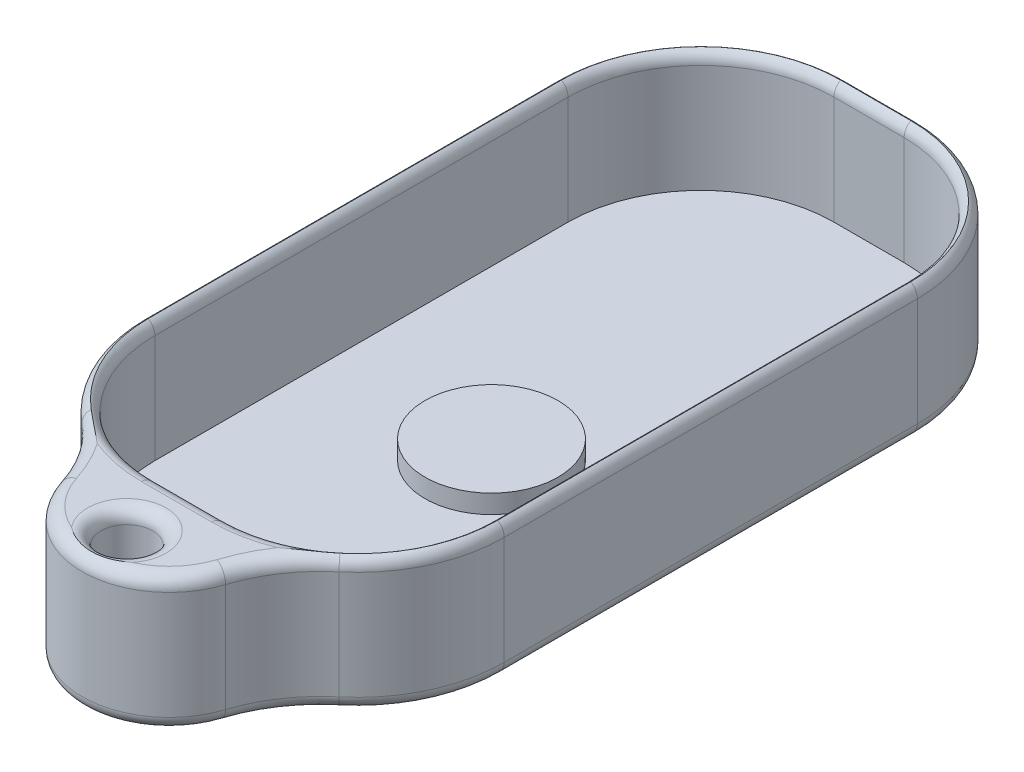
ISO-10303-21;
HEADER;
FILE_DESCRIPTION(('STEP AP214'),'2;1');
FILE_NAME('part.step','',(''),(''),'','','');
FILE_SCHEMA(('AUTOMOTIVE_DESIGN { 1 0 10303 214 1 1 1 1 }'));
ENDSEC;
DATA;
#1=APPLICATION_CONTEXT('core data for automotive mechanical design processes');
#2=APPLICATION_PROTOCOL_DEFINITION('international standard','automotive_design',2000,#1);
#3=PRODUCT_CONTEXT('',#1,'mechanical');
#4=PRODUCT('Part','Part','',(#3));
#5=PRODUCT_RELATED_PRODUCT_CATEGORY('part','',(#4));
#6=PRODUCT_DEFINITION_FORMATION('','',#4);
#7=PRODUCT_DEFINITION_CONTEXT('part definition',#1,'design');
#8=PRODUCT_DEFINITION('design','',#6,#7);
#9=PRODUCT_DEFINITION_SHAPE('','',#8);
#10=(LENGTH_UNIT() NAMED_UNIT(*) SI_UNIT(.MILLI.,.METRE.));
#11=(NAMED_UNIT(*) PLANE_ANGLE_UNIT() SI_UNIT($,.RADIAN.));
#12=(NAMED_UNIT(*) SI_UNIT($,.STERADIAN.) SOLID_ANGLE_UNIT());
#13=UNCERTAINTY_MEASURE_WITH_UNIT(LENGTH_MEASURE(1.E-05),#10,'distance_accuracy_value','');
#14=(GEOMETRIC_REPRESENTATION_CONTEXT(3) GLOBAL_UNCERTAINTY_ASSIGNED_CONTEXT((#13)) GLOBAL_UNIT_ASSIGNED_CONTEXT((#10,
#11,#12)) REPRESENTATION_CONTEXT('',''));
#15=CARTESIAN_POINT('',(0.,0.,0.));
#16=DIRECTION('',(0.,0.,1.));
#17=DIRECTION('',(1.,0.,0.));
#18=AXIS2_PLACEMENT_3D('',#15,#16,#17);
#19=CARTESIAN_POINT('',(12.7,11.6078,-12.7));
#20=DIRECTION('',(0.,-1.,0.));
#21=DIRECTION('',(0.,0.,-1.));
#22=AXIS2_PLACEMENT_3D('',#19,#20,#21);
#23=PLANE('',#22);
#24=DIRECTION('',(1.,0.,0.));
#25=VECTOR('',#24,1.);
#26=CARTESIAN_POINT('',(12.7000000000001,11.6078,1.27));
#27=LINE('',#26,#25);
#28=CARTESIAN_POINT('',(19.4055999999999,11.6078,1.27));
#29=VERTEX_POINT('',#28);
#30=CARTESIAN_POINT('',(12.7000000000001,11.6078,1.27));
#31=VERTEX_POINT('',#30);
#32=EDGE_CURVE('E736',#29,#31,#27,.F.);
#33=ORIENTED_EDGE('',*,*,#32,.T.);
#34=CARTESIAN_POINT('',(12.7,11.6078,-12.7));
#35=DIRECTION('',(0.,-1.,0.));
#36=DIRECTION('',(0.,0.,-1.));
#37=AXIS2_PLACEMENT_3D('',#34,#35,#36);
#38=CIRCLE('',#37,13.97);
#39=CARTESIAN_POINT('',(7.45057983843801,11.6078,0.246215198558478));
#40=VERTEX_POINT('',#39);
#41=EDGE_CURVE('E740',#31,#40,#38,.T.);
#42=ORIENTED_EDGE('',*,*,#41,.T.);
#43=CARTESIAN_POINT('',(-5.18684562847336,11.6078,8.7640246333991));
#44=DIRECTION('',(0.,-1.,0.));
#45=DIRECTION('',(0.,0.,-1.));
#46=AXIS2_PLACEMENT_3D('',#43,#44,#45);
#47=CIRCLE('',#46,15.24);
#48=CARTESIAN_POINT('',(9.33019426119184,11.6078,4.12579729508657));
#49=VERTEX_POINT('',#48);
#50=EDGE_CURVE('E738',#40,#49,#47,.T.);
#51=ORIENTED_EDGE('',*,*,#50,.T.);
#52=CARTESIAN_POINT('',(16.0460768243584,11.6078,1.98005750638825));
#53=DIRECTION('',(0.,-1.,0.));
#54=DIRECTION('',(0.,0.,-1.));
#55=AXIS2_PLACEMENT_3D('',#52,#53,#54);
#56=CIRCLE('',#55,7.0503388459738);
#57=CARTESIAN_POINT('',(13.1563635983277,11.6078,8.41098553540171));
#58=VERTEX_POINT('',#57);
#59=EDGE_CURVE('E576',#49,#58,#56,.F.);
#60=ORIENTED_EDGE('',*,*,#59,.T.);
#61=CARTESIAN_POINT('',(16.0460768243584,11.6078,6.02539395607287));
#62=DIRECTION('',(0.,-1.,0.));
#63=DIRECTION('',(0.,0.,-1.));
#64=AXIS2_PLACEMENT_3D('',#61,#62,#63);
#65=CIRCLE('',#64,3.74719758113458);
#66=CARTESIAN_POINT('',(18.935790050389,11.6078,8.41098553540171));
#67=VERTEX_POINT('',#66);
#68=EDGE_CURVE('E727',#58,#67,#65,.T.);
#69=ORIENTED_EDGE('',*,*,#68,.T.);
#70=CARTESIAN_POINT('',(16.0460768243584,11.6078,1.98005750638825));
#71=DIRECTION('',(0.,-1.,0.));
#72=DIRECTION('',(0.,0.,-1.));
#73=AXIS2_PLACEMENT_3D('',#70,#71,#72);
#74=CIRCLE('',#73,7.0503388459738);
#75=CARTESIAN_POINT('',(22.7604153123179,11.6078,4.13062406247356));
#76=VERTEX_POINT('',#75);
#77=EDGE_CURVE('E729',#67,#76,#74,.F.);
#78=ORIENTED_EDGE('',*,*,#77,.T.);
#79=CARTESIAN_POINT('',(37.2741175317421,11.6078,8.7792849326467));
#80=DIRECTION('',(0.,-1.,0.));
#81=DIRECTION('',(0.,0.,-1.));
#82=AXIS2_PLACEMENT_3D('',#79,#80,#81);
#83=CIRCLE('',#82,15.24);
#84=CARTESIAN_POINT('',(24.6439674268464,11.6078,0.250691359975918));
#85=VERTEX_POINT('',#84);
#86=EDGE_CURVE('E732',#76,#85,#83,.T.);
#87=ORIENTED_EDGE('',*,*,#86,.T.);
#88=CARTESIAN_POINT('',(19.4056,11.6078,-12.7));
#89=DIRECTION('',(0.,-1.,0.));
#90=DIRECTION('',(0.,0.,-1.));
#91=AXIS2_PLACEMENT_3D('',#88,#89,#90);
#92=CIRCLE('',#91,13.97);
#93=EDGE_CURVE('E734',#85,#29,#92,.T.);
#94=ORIENTED_EDGE('',*,*,#93,.T.);
#95=EDGE_LOOP('',(#33,#42,#51,#60,#69,#78,#87,#94));
#96=FACE_BOUND('',#95,.T.);
#97=ADVANCED_FACE('F39',(#96),#23,.F.);
#98=CARTESIAN_POINT('',(12.7,11.6078,-12.7));
#99=DIRECTION('',(0.,-1.,0.));
#100=DIRECTION('',(0.,0.,-1.));
#101=AXIS2_PLACEMENT_3D('',#98,#99,#100);
#102=CYLINDRICAL_SURFACE('',#101,13.97);
#103=DIRECTION('',(0.,-1.,0.));
#104=VECTOR('',#103,1.);
#105=CARTESIAN_POINT('',(3.75657718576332,11.6078,-1.96798768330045));
#106=LINE('',#105,#104);
#107=CARTESIAN_POINT('',(3.75657718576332,10.3378,-1.96798768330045));
#108=VERTEX_POINT('',#107);
#109=CARTESIAN_POINT('',(3.75657718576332,0.,-1.96798768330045));
#110=VERTEX_POINT('',#109);
#111=EDGE_CURVE('E569',#108,#110,#106,.T.);
#112=ORIENTED_EDGE('',*,*,#111,.F.);
#113=CARTESIAN_POINT('',(12.7,10.3378,-12.7));
#114=DIRECTION('',(0.,-1.,0.));
#115=DIRECTION('',(0.,0.,-1.));
#116=AXIS2_PLACEMENT_3D('',#113,#114,#115);
#117=CIRCLE('',#116,13.97);
#118=CARTESIAN_POINT('',(-1.27,10.3378,-12.7000000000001));
#119=VERTEX_POINT('',#118);
#120=EDGE_CURVE('E584',#108,#119,#117,.T.);
#121=ORIENTED_EDGE('',*,*,#120,.T.);
#122=DIRECTION('',(0.,-1.,0.));
#123=VECTOR('',#122,1.);
#124=CARTESIAN_POINT('',(-1.27,11.6078,-12.7000000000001));
#125=LINE('',#124,#123);
#126=CARTESIAN_POINT('',(-1.27,0.,-12.7000000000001));
#127=VERTEX_POINT('',#126);
#128=EDGE_CURVE('E658',#119,#127,#125,.T.);
#129=ORIENTED_EDGE('',*,*,#128,.T.);
#130=CARTESIAN_POINT('',(12.7,0.,-12.7));
#131=DIRECTION('',(0.,-1.,0.));
#132=DIRECTION('',(0.,0.,-1.));
#133=AXIS2_PLACEMENT_3D('',#130,#131,#132);
#134=CIRCLE('',#133,13.97);
#135=EDGE_CURVE('E582',#127,#110,#134,.F.);
#136=ORIENTED_EDGE('',*,*,#135,.T.);
#137=EDGE_LOOP('',(#112,#121,#129,#136));
#138=FACE_BOUND('',#137,.T.);
#139=ADVANCED_FACE('F509',(#138),#102,.T.);
#140=CARTESIAN_POINT('',(-5.18684562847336,11.6078,8.7640246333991));
#141=DIRECTION('',(0.,-1.,0.));
#142=DIRECTION('',(0.,0.,-1.));
#143=AXIS2_PLACEMENT_3D('',#140,#141,#142);
#144=CYLINDRICAL_SURFACE('',#143,13.97);
#145=DIRECTION('',(0.,-1.,0.));
#146=VECTOR('',#145,1.);
#147=CARTESIAN_POINT('',(8.12044093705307,11.6078,4.51231623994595));
#148=LINE('',#147,#146);
#149=CARTESIAN_POINT('',(8.12044093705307,10.3378,4.51231623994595));
#150=VERTEX_POINT('',#149);
#151=CARTESIAN_POINT('',(8.12044093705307,0.,4.51231623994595));
#152=VERTEX_POINT('',#151);
#153=EDGE_CURVE('E561',#150,#152,#148,.T.);
#154=ORIENTED_EDGE('',*,*,#153,.F.);
#155=CARTESIAN_POINT('',(-5.18684562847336,10.3378,8.7640246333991));
#156=DIRECTION('',(0.,-1.,0.));
#157=DIRECTION('',(0.,0.,-1.));
#158=AXIS2_PLACEMENT_3D('',#155,#156,#157);
#159=CIRCLE('',#158,13.97);
#160=EDGE_CURVE('E565',#150,#108,#159,.F.);
#161=ORIENTED_EDGE('',*,*,#160,.T.);
#162=ORIENTED_EDGE('',*,*,#111,.T.);
#163=CARTESIAN_POINT('',(-5.18684562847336,0.,8.7640246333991));
#164=DIRECTION('',(0.,-1.,0.));
#165=DIRECTION('',(0.,0.,-1.));
#166=AXIS2_PLACEMENT_3D('',#163,#164,#165);
#167=CIRCLE('',#166,13.97);
#168=EDGE_CURVE('E567',#110,#152,#167,.T.);
#169=ORIENTED_EDGE('',*,*,#168,.T.);
#170=EDGE_LOOP('',(#154,#161,#162,#169));
#171=FACE_BOUND('',#170,.T.);
#172=ADVANCED_FACE('F515',(#171),#144,.F.);
#173=CARTESIAN_POINT('',(16.0460768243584,11.6078,1.98005750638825));
#174=DIRECTION('',(0.,-1.,0.));
#175=DIRECTION('',(0.,0.,-1.));
#176=AXIS2_PLACEMENT_3D('',#173,#174,#175);
#177=CYLINDRICAL_SURFACE('',#176,8.3203388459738);
#178=DIRECTION('',(0.,-1.,0.));
#179=VECTOR('',#178,1.);
#180=CARTESIAN_POINT('',(23.9698904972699,11.6078,4.51801246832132));
#181=LINE('',#180,#179);
#182=CARTESIAN_POINT('',(23.9698904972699,10.3378,4.51801246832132));
#183=VERTEX_POINT('',#182);
#184=CARTESIAN_POINT('',(23.9698904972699,0.,4.51801246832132));
#185=VERTEX_POINT('',#184);
#186=EDGE_CURVE('E570',#183,#185,#181,.T.);
#187=ORIENTED_EDGE('',*,*,#186,.F.);
#188=CARTESIAN_POINT('',(16.0460768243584,10.3378,1.98005750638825));
#189=DIRECTION('',(0.,-1.,0.));
#190=DIRECTION('',(0.,0.,-1.));
#191=AXIS2_PLACEMENT_3D('',#188,#189,#190);
#192=CIRCLE('',#191,8.3203388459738);
#193=EDGE_CURVE('E575',#183,#150,#192,.T.);
#194=ORIENTED_EDGE('',*,*,#193,.T.);
#195=ORIENTED_EDGE('',*,*,#153,.T.);
#196=CARTESIAN_POINT('',(16.0460768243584,0.,1.98005750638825));
#197=DIRECTION('',(0.,-1.,0.));
#198=DIRECTION('',(0.,0.,-1.));
#199=AXIS2_PLACEMENT_3D('',#196,#197,#198);
#200=CIRCLE('',#199,8.3203388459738);
#201=EDGE_CURVE('E716',#152,#185,#200,.F.);
#202=ORIENTED_EDGE('',*,*,#201,.T.);
#203=EDGE_LOOP('',(#187,#194,#195,#202));
#204=FACE_BOUND('',#203,.T.);
#205=ADVANCED_FACE('F550',(#204),#177,.T.);
#206=CARTESIAN_POINT('',(37.2741175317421,11.6078,8.7792849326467));
#207=DIRECTION('',(0.,-1.,0.));
#208=DIRECTION('',(0.,0.,-1.));
#209=AXIS2_PLACEMENT_3D('',#206,#207,#208);
#210=CYLINDRICAL_SURFACE('',#209,13.97);
#211=DIRECTION('',(0.,-1.,0.));
#212=VECTOR('',#211,1.);
#213=CARTESIAN_POINT('',(28.3398587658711,11.6078,-1.96035753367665));
#214=LINE('',#213,#212);
#215=CARTESIAN_POINT('',(28.3398587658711,10.3378,-1.96035753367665));
#216=VERTEX_POINT('',#215);
#217=CARTESIAN_POINT('',(28.3398587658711,0.,-1.96035753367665));
#218=VERTEX_POINT('',#217);
#219=EDGE_CURVE('E616',#216,#218,#214,.T.);
#220=ORIENTED_EDGE('',*,*,#219,.F.);
#221=CARTESIAN_POINT('',(37.2741175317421,10.3378,8.7792849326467));
#222=DIRECTION('',(0.,-1.,0.));
#223=DIRECTION('',(0.,0.,-1.));
#224=AXIS2_PLACEMENT_3D('',#221,#222,#223);
#225=CIRCLE('',#224,13.97);
#226=EDGE_CURVE('E622',#216,#183,#225,.F.);
#227=ORIENTED_EDGE('',*,*,#226,.T.);
#228=ORIENTED_EDGE('',*,*,#186,.T.);
#229=CARTESIAN_POINT('',(37.2741175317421,0.,8.7792849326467));
#230=DIRECTION('',(0.,-1.,0.));
#231=DIRECTION('',(0.,0.,-1.));
#232=AXIS2_PLACEMENT_3D('',#229,#230,#231);
#233=CIRCLE('',#232,13.97);
#234=EDGE_CURVE('E621',#185,#218,#233,.T.);
#235=ORIENTED_EDGE('',*,*,#234,.T.);
#236=EDGE_LOOP('',(#220,#227,#228,#235));
#237=FACE_BOUND('',#236,.T.);
#238=ADVANCED_FACE('F546',(#237),#210,.F.);
#239=CARTESIAN_POINT('',(19.4056,11.6078,-12.7));
#240=DIRECTION('',(0.,-1.,0.));
#241=DIRECTION('',(0.,0.,-1.));
#242=AXIS2_PLACEMENT_3D('',#239,#240,#241);
#243=CYLINDRICAL_SURFACE('',#242,13.97);
#244=DIRECTION('',(0.,-1.,0.));
#245=VECTOR('',#244,1.);
#246=CARTESIAN_POINT('',(33.3756,11.6078,-12.7000000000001));
#247=LINE('',#246,#245);
#248=CARTESIAN_POINT('',(33.3756,10.3378,-12.7000000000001));
#249=VERTEX_POINT('',#248);
#250=CARTESIAN_POINT('',(33.3756,0.,-12.7000000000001));
#251=VERTEX_POINT('',#250);
#252=EDGE_CURVE('E619',#249,#251,#247,.T.);
#253=ORIENTED_EDGE('',*,*,#252,.F.);
#254=CARTESIAN_POINT('',(19.4056,10.3378,-12.7));
#255=DIRECTION('',(0.,-1.,0.));
#256=DIRECTION('',(0.,0.,-1.));
#257=AXIS2_PLACEMENT_3D('',#254,#255,#256);
#258=CIRCLE('',#257,13.97);
#259=EDGE_CURVE('E623',#249,#216,#258,.T.);
#260=ORIENTED_EDGE('',*,*,#259,.T.);
#261=ORIENTED_EDGE('',*,*,#219,.T.);
#262=CARTESIAN_POINT('',(19.4056,0.,-12.7));
#263=DIRECTION('',(0.,-1.,0.));
#264=DIRECTION('',(0.,0.,-1.));
#265=AXIS2_PLACEMENT_3D('',#262,#263,#264);
#266=CIRCLE('',#265,13.97);
#267=EDGE_CURVE('E710',#218,#251,#266,.F.);
#268=ORIENTED_EDGE('',*,*,#267,.T.);
#269=EDGE_LOOP('',(#253,#260,#261,#268));
#270=FACE_BOUND('',#269,.T.);
#271=ADVANCED_FACE('F542',(#270),#243,.T.);
#272=CARTESIAN_POINT('',(33.3756,11.6078,-12.7000000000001));
#273=DIRECTION('',(-1.,0.,0.));
#274=DIRECTION('',(0.,0.,1.));
#275=AXIS2_PLACEMENT_3D('',#272,#273,#274);
#276=PLANE('',#275);
#277=DIRECTION('',(0.,-1.,0.));
#278=VECTOR('',#277,1.);
#279=CARTESIAN_POINT('',(33.3756,11.6078,-52.1716));
#280=LINE('',#279,#278);
#281=CARTESIAN_POINT('',(33.3756,10.3378,-52.1716));
#282=VERTEX_POINT('',#281);
#283=CARTESIAN_POINT('',(33.3756,0.,-52.1716));
#284=VERTEX_POINT('',#283);
#285=EDGE_CURVE('E835',#282,#284,#280,.T.);
#286=ORIENTED_EDGE('',*,*,#285,.F.);
#287=DIRECTION('',(0.,0.,-1.));
#288=VECTOR('',#287,1.);
#289=CARTESIAN_POINT('',(33.3756,10.3378,-12.7000000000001));
#290=LINE('',#289,#288);
#291=EDGE_CURVE('E707',#282,#249,#290,.F.);
#292=ORIENTED_EDGE('',*,*,#291,.T.);
#293=ORIENTED_EDGE('',*,*,#252,.T.);
#294=DIRECTION('',(0.,0.,1.));
#295=VECTOR('',#294,1.);
#296=CARTESIAN_POINT('',(33.3756,0.,-52.1716));
#297=LINE('',#296,#295);
#298=EDGE_CURVE('E705',#251,#284,#297,.F.);
#299=ORIENTED_EDGE('',*,*,#298,.T.);
#300=EDGE_LOOP('',(#286,#292,#293,#299));
#301=FACE_BOUND('',#300,.T.);
#302=ADVANCED_FACE('F538',(#301),#276,.F.);
#303=CARTESIAN_POINT('',(19.4056,11.6078,-52.1716));
#304=DIRECTION('',(0.,-1.,0.));
#305=DIRECTION('',(0.,0.,-1.));
#306=AXIS2_PLACEMENT_3D('',#303,#304,#305);
#307=CYLINDRICAL_SURFACE('',#306,13.97);
#308=DIRECTION('',(0.,-1.,0.));
#309=VECTOR('',#308,1.);
#310=CARTESIAN_POINT('',(19.4055999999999,11.6078,-66.1416));
#311=LINE('',#310,#309);
#312=CARTESIAN_POINT('',(19.4055999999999,10.3378,-66.1416));
#313=VERTEX_POINT('',#312);
#314=CARTESIAN_POINT('',(19.4055999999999,0.,-66.1416));
#315=VERTEX_POINT('',#314);
#316=EDGE_CURVE('E833',#313,#315,#311,.T.);
#317=ORIENTED_EDGE('',*,*,#316,.F.);
#318=CARTESIAN_POINT('',(19.4056,10.3378,-52.1716));
#319=DIRECTION('',(0.,-1.,0.));
#320=DIRECTION('',(0.,0.,-1.));
#321=AXIS2_PLACEMENT_3D('',#318,#319,#320);
#322=CIRCLE('',#321,13.97);
#323=EDGE_CURVE('E703',#313,#282,#322,.T.);
#324=ORIENTED_EDGE('',*,*,#323,.T.);
#325=ORIENTED_EDGE('',*,*,#285,.T.);
#326=CARTESIAN_POINT('',(19.4056,0.,-52.1716));
#327=DIRECTION('',(0.,-1.,0.));
#328=DIRECTION('',(0.,0.,-1.));
#329=AXIS2_PLACEMENT_3D('',#326,#327,#328);
#330=CIRCLE('',#329,13.97);
#331=EDGE_CURVE('E296',#284,#315,#330,.F.);
#332=ORIENTED_EDGE('',*,*,#331,.T.);
#333=EDGE_LOOP('',(#317,#324,#325,#332));
#334=FACE_BOUND('',#333,.T.);
#335=ADVANCED_FACE('F534',(#334),#307,.T.);
#336=CARTESIAN_POINT('',(12.7000000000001,11.6078,-66.1416));
#337=DIRECTION('',(0.,0.,1.));
#338=DIRECTION('',(1.,0.,0.));
#339=AXIS2_PLACEMENT_3D('',#336,#337,#338);
#340=PLANE('',#339);
#341=DIRECTION('',(0.,-1.,0.));
#342=VECTOR('',#341,1.);
#343=CARTESIAN_POINT('',(12.7000000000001,11.6078,-66.1416));
#344=LINE('',#343,#342);
#345=CARTESIAN_POINT('',(12.7000000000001,10.3378,-66.1416));
#346=VERTEX_POINT('',#345);
#347=CARTESIAN_POINT('',(12.7000000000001,0.,-66.1416));
#348=VERTEX_POINT('',#347);
#349=EDGE_CURVE('E657',#346,#348,#344,.T.);
#350=ORIENTED_EDGE('',*,*,#349,.F.);
#351=DIRECTION('',(-1.,0.,0.));
#352=VECTOR('',#351,1.);
#353=CARTESIAN_POINT('',(12.7000000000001,10.3378,-66.1416));
#354=LINE('',#353,#352);
#355=EDGE_CURVE('E698',#346,#313,#354,.F.);
#356=ORIENTED_EDGE('',*,*,#355,.T.);
#357=ORIENTED_EDGE('',*,*,#316,.T.);
#358=DIRECTION('',(1.,0.,0.));
#359=VECTOR('',#358,1.);
#360=CARTESIAN_POINT('',(12.7000000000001,0.,-66.1416));
#361=LINE('',#360,#359);
#362=EDGE_CURVE('E676',#315,#348,#361,.F.);
#363=ORIENTED_EDGE('',*,*,#362,.T.);
#364=EDGE_LOOP('',(#350,#356,#357,#363));
#365=FACE_BOUND('',#364,.T.);
#366=ADVANCED_FACE('F530',(#365),#340,.F.);
#367=CARTESIAN_POINT('',(12.7,11.6078,-52.1716));
#368=DIRECTION('',(0.,-1.,0.));
#369=DIRECTION('',(0.,0.,-1.));
#370=AXIS2_PLACEMENT_3D('',#367,#368,#369);
#371=CYLINDRICAL_SURFACE('',#370,13.97);
#372=DIRECTION('',(0.,-1.,0.));
#373=VECTOR('',#372,1.);
#374=CARTESIAN_POINT('',(-1.27,11.6078,-52.1715999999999));
#375=LINE('',#374,#373);
#376=CARTESIAN_POINT('',(-1.27,10.3378,-52.1715999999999));
#377=VERTEX_POINT('',#376);
#378=CARTESIAN_POINT('',(-1.27,0.,-52.1715999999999));
#379=VERTEX_POINT('',#378);
#380=EDGE_CURVE('E654',#377,#379,#375,.T.);
#381=ORIENTED_EDGE('',*,*,#380,.F.);
#382=CARTESIAN_POINT('',(12.7,10.3378,-52.1716));
#383=DIRECTION('',(0.,-1.,0.));
#384=DIRECTION('',(0.,0.,-1.));
#385=AXIS2_PLACEMENT_3D('',#382,#383,#384);
#386=CIRCLE('',#385,13.97);
#387=EDGE_CURVE('E651',#377,#346,#386,.T.);
#388=ORIENTED_EDGE('',*,*,#387,.T.);
#389=ORIENTED_EDGE('',*,*,#349,.T.);
#390=CARTESIAN_POINT('',(12.7,0.,-52.1716));
#391=DIRECTION('',(0.,-1.,0.));
#392=DIRECTION('',(0.,0.,-1.));
#393=AXIS2_PLACEMENT_3D('',#390,#391,#392);
#394=CIRCLE('',#393,13.97);
#395=EDGE_CURVE('E650',#348,#379,#394,.F.);
#396=ORIENTED_EDGE('',*,*,#395,.T.);
#397=EDGE_LOOP('',(#381,#388,#389,#396));
#398=FACE_BOUND('',#397,.T.);
#399=ADVANCED_FACE('F526',(#398),#371,.T.);
#400=CARTESIAN_POINT('',(-1.27,11.6078,-12.7000000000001));
#401=DIRECTION('',(1.,0.,0.));
#402=DIRECTION('',(0.,0.,-1.));
#403=AXIS2_PLACEMENT_3D('',#400,#401,#402);
#404=PLANE('',#403);
#405=ORIENTED_EDGE('',*,*,#128,.F.);
#406=DIRECTION('',(0.,0.,1.));
#407=VECTOR('',#406,1.);
#408=CARTESIAN_POINT('',(-1.27,10.3378,-12.7000000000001));
#409=LINE('',#408,#407);
#410=EDGE_CURVE('E639',#119,#377,#409,.F.);
#411=ORIENTED_EDGE('',*,*,#410,.T.);
#412=ORIENTED_EDGE('',*,*,#380,.T.);
#413=DIRECTION('',(0.,0.,-1.));
#414=VECTOR('',#413,1.);
#415=CARTESIAN_POINT('',(-1.27,0.,-12.7000000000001));
#416=LINE('',#415,#414);
#417=EDGE_CURVE('E637',#379,#127,#416,.F.);
#418=ORIENTED_EDGE('',*,*,#417,.T.);
#419=EDGE_LOOP('',(#405,#411,#412,#418));
#420=FACE_BOUND('',#419,.T.);
#421=ADVANCED_FACE('F523',(#420),#404,.F.);
#422=CARTESIAN_POINT('',(12.7,11.6078,-12.7));
#423=DIRECTION('',(0.,-1.,0.));
#424=DIRECTION('',(0.,0.,-1.));
#425=AXIS2_PLACEMENT_3D('',#422,#423,#424);
#426=CYLINDRICAL_SURFACE('',#425,12.7);
#427=DIRECTION('',(0.,-1.,0.));
#428=VECTOR('',#427,1.);
#429=CARTESIAN_POINT('',(0.,11.6078,-12.7000000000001));
#430=LINE('',#429,#428);
#431=CARTESIAN_POINT('',(0.,10.3378,-12.7000000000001));
#432=VERTEX_POINT('',#431);
#433=CARTESIAN_POINT('',(0.,0.,-12.7000000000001));
#434=VERTEX_POINT('',#433);
#435=EDGE_CURVE('E109',#432,#434,#430,.T.);
#436=ORIENTED_EDGE('',*,*,#435,.F.);
#437=CARTESIAN_POINT('',(12.7,10.3378,-12.7));
#438=DIRECTION('',(0.,-1.,0.));
#439=DIRECTION('',(0.,0.,-1.));
#440=AXIS2_PLACEMENT_3D('',#437,#438,#439);
#441=CIRCLE('',#440,12.7);
#442=CARTESIAN_POINT('',(12.7000000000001,10.3378,0.));
#443=VERTEX_POINT('',#442);
#444=EDGE_CURVE('E640',#432,#443,#441,.F.);
#445=ORIENTED_EDGE('',*,*,#444,.T.);
#446=DIRECTION('',(0.,-1.,0.));
#447=VECTOR('',#446,1.);
#448=CARTESIAN_POINT('',(12.7000000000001,11.6078,0.));
#449=LINE('',#448,#447);
#450=CARTESIAN_POINT('',(12.7000000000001,0.,0.));
#451=VERTEX_POINT('',#450);
#452=EDGE_CURVE('E754',#443,#451,#449,.T.);
#453=ORIENTED_EDGE('',*,*,#452,.T.);
#454=CARTESIAN_POINT('',(12.7,0.,-12.7));
#455=DIRECTION('',(0.,1.,0.));
#456=DIRECTION('',(0.,0.,-1.));
#457=AXIS2_PLACEMENT_3D('',#454,#455,#456);
#458=CIRCLE('',#457,12.7);
#459=EDGE_CURVE('E629',#434,#451,#458,.T.);
#460=ORIENTED_EDGE('',*,*,#459,.F.);
#461=EDGE_LOOP('',(#436,#445,#453,#460));
#462=FACE_BOUND('',#461,.T.);
#463=ADVANCED_FACE('F521',(#462),#426,.F.);
#464=CARTESIAN_POINT('',(12.7000000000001,11.6078,0.));
#465=DIRECTION('',(0.,0.,-1.));
#466=DIRECTION('',(-1.,0.,0.));
#467=AXIS2_PLACEMENT_3D('',#464,#465,#466);
#468=PLANE('',#467);
#469=ORIENTED_EDGE('',*,*,#452,.F.);
#470=DIRECTION('',(1.,0.,0.));
#471=VECTOR('',#470,1.);
#472=CARTESIAN_POINT('',(19.4055999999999,10.3378,0.));
#473=LINE('',#472,#471);
#474=CARTESIAN_POINT('',(19.4055999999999,10.3378,0.));
#475=VERTEX_POINT('',#474);
#476=EDGE_CURVE('E724',#443,#475,#473,.T.);
#477=ORIENTED_EDGE('',*,*,#476,.T.);
#478=DIRECTION('',(0.,-1.,0.));
#479=VECTOR('',#478,1.);
#480=CARTESIAN_POINT('',(19.4055999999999,11.6078,0.));
#481=LINE('',#480,#479);
#482=CARTESIAN_POINT('',(19.4055999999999,0.,0.));
#483=VERTEX_POINT('',#482);
#484=EDGE_CURVE('E766',#475,#483,#481,.T.);
#485=ORIENTED_EDGE('',*,*,#484,.T.);
#486=DIRECTION('',(1.,0.,0.));
#487=VECTOR('',#486,1.);
#488=CARTESIAN_POINT('',(12.7000000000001,0.,0.));
#489=LINE('',#488,#487);
#490=EDGE_CURVE('E764',#451,#483,#489,.T.);
#491=ORIENTED_EDGE('',*,*,#490,.F.);
#492=EDGE_LOOP('',(#469,#477,#485,#491));
#493=FACE_BOUND('',#492,.T.);
#494=ADVANCED_FACE('F761',(#493),#468,.T.);
#495=CARTESIAN_POINT('',(19.4056,11.6078,-12.7));
#496=DIRECTION('',(0.,-1.,0.));
#497=DIRECTION('',(0.,0.,-1.));
#498=AXIS2_PLACEMENT_3D('',#495,#496,#497);
#499=CYLINDRICAL_SURFACE('',#498,12.7);
#500=ORIENTED_EDGE('',*,*,#484,.F.);
#501=CARTESIAN_POINT('',(19.4056,10.3378,-12.7));
#502=DIRECTION('',(0.,-1.,0.));
#503=DIRECTION('',(0.,0.,-1.));
#504=AXIS2_PLACEMENT_3D('',#501,#502,#503);
#505=CIRCLE('',#504,12.7);
#506=CARTESIAN_POINT('',(32.1056,10.3378,-12.7000000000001));
#507=VERTEX_POINT('',#506);
#508=EDGE_CURVE('E742',#475,#507,#505,.F.);
#509=ORIENTED_EDGE('',*,*,#508,.T.);
#510=DIRECTION('',(0.,-1.,0.));
#511=VECTOR('',#510,1.);
#512=CARTESIAN_POINT('',(32.1056,11.6078,-12.7000000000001));
#513=LINE('',#512,#511);
#514=CARTESIAN_POINT('',(32.1056,0.,-12.7000000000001));
#515=VERTEX_POINT('',#514);
#516=EDGE_CURVE('E778',#507,#515,#513,.T.);
#517=ORIENTED_EDGE('',*,*,#516,.T.);
#518=CARTESIAN_POINT('',(19.4056,0.,-12.7));
#519=DIRECTION('',(0.,1.,0.));
#520=DIRECTION('',(0.,0.,1.));
#521=AXIS2_PLACEMENT_3D('',#518,#519,#520);
#522=CIRCLE('',#521,12.7);
#523=EDGE_CURVE('E613',#483,#515,#522,.T.);
#524=ORIENTED_EDGE('',*,*,#523,.F.);
#525=EDGE_LOOP('',(#500,#509,#517,#524));
#526=FACE_BOUND('',#525,.T.);
#527=ADVANCED_FACE('F776',(#526),#499,.F.);
#528=CARTESIAN_POINT('',(32.1056,11.6078,-12.7000000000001));
#529=DIRECTION('',(-1.,0.,0.));
#530=DIRECTION('',(0.,0.,1.));
#531=AXIS2_PLACEMENT_3D('',#528,#529,#530);
#532=PLANE('',#531);
#533=ORIENTED_EDGE('',*,*,#516,.F.);
#534=DIRECTION('',(0.,0.,-1.));
#535=VECTOR('',#534,1.);
#536=CARTESIAN_POINT('',(32.1056,10.3378,-52.1715999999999));
#537=LINE('',#536,#535);
#538=CARTESIAN_POINT('',(32.1056,10.3378,-52.1715999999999));
#539=VERTEX_POINT('',#538);
#540=EDGE_CURVE('E745',#507,#539,#537,.T.);
#541=ORIENTED_EDGE('',*,*,#540,.T.);
#542=DIRECTION('',(0.,-1.,0.));
#543=VECTOR('',#542,1.);
#544=CARTESIAN_POINT('',(32.1056,11.6078,-52.1715999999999));
#545=LINE('',#544,#543);
#546=CARTESIAN_POINT('',(32.1056,0.,-52.1715999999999));
#547=VERTEX_POINT('',#546);
#548=EDGE_CURVE('E788',#539,#547,#545,.T.);
#549=ORIENTED_EDGE('',*,*,#548,.T.);
#550=DIRECTION('',(0.,0.,-1.));
#551=VECTOR('',#550,1.);
#552=CARTESIAN_POINT('',(32.1056,0.,-12.7000000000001));
#553=LINE('',#552,#551);
#554=EDGE_CURVE('E785',#515,#547,#553,.T.);
#555=ORIENTED_EDGE('',*,*,#554,.F.);
#556=EDGE_LOOP('',(#533,#541,#549,#555));
#557=FACE_BOUND('',#556,.T.);
#558=ADVANCED_FACE('F782',(#557),#532,.T.);
#559=CARTESIAN_POINT('',(19.4056,11.6078,-52.1716));
#560=DIRECTION('',(0.,-1.,0.));
#561=DIRECTION('',(0.,0.,-1.));
#562=AXIS2_PLACEMENT_3D('',#559,#560,#561);
#563=CYLINDRICAL_SURFACE('',#562,12.7);
#564=ORIENTED_EDGE('',*,*,#548,.F.);
#565=CARTESIAN_POINT('',(19.4056,10.3378,-52.1716));
#566=DIRECTION('',(0.,-1.,0.));
#567=DIRECTION('',(0.,0.,-1.));
#568=AXIS2_PLACEMENT_3D('',#565,#566,#567);
#569=CIRCLE('',#568,12.7);
#570=CARTESIAN_POINT('',(19.4055999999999,10.3378,-64.8716));
#571=VERTEX_POINT('',#570);
#572=EDGE_CURVE('E748',#539,#571,#569,.F.);
#573=ORIENTED_EDGE('',*,*,#572,.T.);
#574=DIRECTION('',(0.,-1.,0.));
#575=VECTOR('',#574,1.);
#576=CARTESIAN_POINT('',(19.4055999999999,11.6078,-64.8716));
#577=LINE('',#576,#575);
#578=CARTESIAN_POINT('',(19.4055999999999,0.,-64.8716));
#579=VERTEX_POINT('',#578);
#580=EDGE_CURVE('E802',#571,#579,#577,.T.);
#581=ORIENTED_EDGE('',*,*,#580,.T.);
#582=CARTESIAN_POINT('',(19.4056,0.,-52.1716));
#583=DIRECTION('',(0.,1.,0.));
#584=DIRECTION('',(0.,0.,-1.));
#585=AXIS2_PLACEMENT_3D('',#582,#583,#584);
#586=CIRCLE('',#585,12.7);
#587=EDGE_CURVE('E821',#547,#579,#586,.T.);
#588=ORIENTED_EDGE('',*,*,#587,.F.);
#589=EDGE_LOOP('',(#564,#573,#581,#588));
#590=FACE_BOUND('',#589,.T.);
#591=ADVANCED_FACE('F800',(#590),#563,.F.);
#592=CARTESIAN_POINT('',(12.7000000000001,11.6078,-64.8716));
#593=DIRECTION('',(0.,0.,1.));
#594=DIRECTION('',(1.,0.,0.));
#595=AXIS2_PLACEMENT_3D('',#592,#593,#594);
#596=PLANE('',#595);
#597=ORIENTED_EDGE('',*,*,#580,.F.);
#598=DIRECTION('',(-1.,0.,0.));
#599=VECTOR('',#598,1.);
#600=CARTESIAN_POINT('',(12.7000000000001,10.3378,-64.8716));
#601=LINE('',#600,#599);
#602=CARTESIAN_POINT('',(12.7000000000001,10.3378,-64.8716));
#603=VERTEX_POINT('',#602);
#604=EDGE_CURVE('E673',#571,#603,#601,.T.);
#605=ORIENTED_EDGE('',*,*,#604,.T.);
#606=DIRECTION('',(0.,-1.,0.));
#607=VECTOR('',#606,1.);
#608=CARTESIAN_POINT('',(12.7000000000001,11.6078,-64.8716));
#609=LINE('',#608,#607);
#610=CARTESIAN_POINT('',(12.7000000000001,0.,-64.8716));
#611=VERTEX_POINT('',#610);
#612=EDGE_CURVE('E648',#603,#611,#609,.T.);
#613=ORIENTED_EDGE('',*,*,#612,.T.);
#614=DIRECTION('',(-1.,0.,0.));
#615=VECTOR('',#614,1.);
#616=CARTESIAN_POINT('',(12.7000000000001,0.,-64.8716));
#617=LINE('',#616,#615);
#618=EDGE_CURVE('E644',#579,#611,#617,.T.);
#619=ORIENTED_EDGE('',*,*,#618,.F.);
#620=EDGE_LOOP('',(#597,#605,#613,#619));
#621=FACE_BOUND('',#620,.T.);
#622=ADVANCED_FACE('F806',(#621),#596,.T.);
#623=CARTESIAN_POINT('',(12.7,11.6078,-52.1716));
#624=DIRECTION('',(0.,-1.,0.));
#625=DIRECTION('',(0.,0.,-1.));
#626=AXIS2_PLACEMENT_3D('',#623,#624,#625);
#627=CYLINDRICAL_SURFACE('',#626,12.7);
#628=ORIENTED_EDGE('',*,*,#612,.F.);
#629=CARTESIAN_POINT('',(12.7,10.3378,-52.1716));
#630=DIRECTION('',(0.,-1.,0.));
#631=DIRECTION('',(0.,0.,-1.));
#632=AXIS2_PLACEMENT_3D('',#629,#630,#631);
#633=CIRCLE('',#632,12.7);
#634=CARTESIAN_POINT('',(0.,10.3378,-52.1715999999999));
#635=VERTEX_POINT('',#634);
#636=EDGE_CURVE('E661',#603,#635,#633,.F.);
#637=ORIENTED_EDGE('',*,*,#636,.T.);
#638=DIRECTION('',(0.,-1.,0.));
#639=VECTOR('',#638,1.);
#640=CARTESIAN_POINT('',(0.,11.6078,-52.1715999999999));
#641=LINE('',#640,#639);
#642=CARTESIAN_POINT('',(0.,0.,-52.1715999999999));
#643=VERTEX_POINT('',#642);
#644=EDGE_CURVE('E646',#635,#643,#641,.T.);
#645=ORIENTED_EDGE('',*,*,#644,.T.);
#646=CARTESIAN_POINT('',(12.7,0.,-52.1716));
#647=DIRECTION('',(0.,1.,0.));
#648=DIRECTION('',(0.,0.,-1.));
#649=AXIS2_PLACEMENT_3D('',#646,#647,#648);
#650=CIRCLE('',#649,12.7);
#651=EDGE_CURVE('E634',#611,#643,#650,.T.);
#652=ORIENTED_EDGE('',*,*,#651,.F.);
#653=EDGE_LOOP('',(#628,#637,#645,#652));
#654=FACE_BOUND('',#653,.T.);
#655=ADVANCED_FACE('F816',(#654),#627,.F.);
#656=CARTESIAN_POINT('',(0.,11.6078,-12.7000000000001));
#657=DIRECTION('',(1.,0.,0.));
#658=DIRECTION('',(0.,0.,-1.));
#659=AXIS2_PLACEMENT_3D('',#656,#657,#658);
#660=PLANE('',#659);
#661=ORIENTED_EDGE('',*,*,#644,.F.);
#662=DIRECTION('',(0.,0.,1.));
#663=VECTOR('',#662,1.);
#664=CARTESIAN_POINT('',(0.,10.3378,-12.7000000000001));
#665=LINE('',#664,#663);
#666=EDGE_CURVE('E660',#635,#432,#665,.T.);
#667=ORIENTED_EDGE('',*,*,#666,.T.);
#668=ORIENTED_EDGE('',*,*,#435,.T.);
#669=DIRECTION('',(0.,0.,1.));
#670=VECTOR('',#669,1.);
#671=CARTESIAN_POINT('',(0.,0.,-12.7000000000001));
#672=LINE('',#671,#670);
#673=EDGE_CURVE('E632',#643,#434,#672,.T.);
#674=ORIENTED_EDGE('',*,*,#673,.F.);
#675=EDGE_LOOP('',(#661,#667,#668,#674));
#676=FACE_BOUND('',#675,.T.);
#677=ADVANCED_FACE('F818',(#676),#660,.T.);
#678=CARTESIAN_POINT('',(19.4056,0.,-52.1716));
#679=DIRECTION('',(0.,-1.,0.));
#680=DIRECTION('',(0.,0.,-1.));
#681=AXIS2_PLACEMENT_3D('',#678,#679,#680);
#682=PLANE('',#681);
#683=CARTESIAN_POINT('',(16.0528,0.,-28.8036));
#684=DIRECTION('',(0.,-1.,0.));
#685=DIRECTION('',(0.,0.,-1.));
#686=AXIS2_PLACEMENT_3D('',#683,#684,#685);
#687=CIRCLE('',#686,6.35);
#688=CARTESIAN_POINT('',(16.0528,0.,-35.1536));
#689=VERTEX_POINT('',#688);
#690=EDGE_CURVE('E626',#689,#689,#687,.T.);
#691=ORIENTED_EDGE('',*,*,#690,.T.);
#692=EDGE_LOOP('',(#691));
#693=FACE_BOUND('',#692,.T.);
#694=ORIENTED_EDGE('',*,*,#459,.T.);
#695=ORIENTED_EDGE('',*,*,#490,.T.);
#696=ORIENTED_EDGE('',*,*,#523,.T.);
#697=ORIENTED_EDGE('',*,*,#554,.T.);
#698=ORIENTED_EDGE('',*,*,#587,.T.);
#699=ORIENTED_EDGE('',*,*,#618,.T.);
#700=ORIENTED_EDGE('',*,*,#651,.T.);
#701=ORIENTED_EDGE('',*,*,#673,.T.);
#702=EDGE_LOOP('',(#694,#695,#696,#697,#698,#699,#700,#701));
#703=FACE_BOUND('',#702,.T.);
#704=ADVANCED_FACE('F820',(#693,#703),#682,.F.);
#705=CARTESIAN_POINT('',(19.4056,-1.27,-52.1716));
#706=DIRECTION('',(0.,-1.,0.));
#707=DIRECTION('',(0.,0.,-1.));
#708=AXIS2_PLACEMENT_3D('',#705,#706,#707);
#709=PLANE('',#708);
#710=CARTESIAN_POINT('',(19.4056,-1.27,-12.7));
#711=DIRECTION('',(0.,-1.,0.));
#712=DIRECTION('',(0.,0.,-1.));
#713=AXIS2_PLACEMENT_3D('',#710,#711,#712);
#714=CIRCLE('',#713,12.7);
#715=CARTESIAN_POINT('',(32.1056,-1.27,-12.7000000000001));
#716=VERTEX_POINT('',#715);
#717=CARTESIAN_POINT('',(27.5276534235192,-1.27,-2.93668866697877));
#718=VERTEX_POINT('',#717);
#719=EDGE_CURVE('E54',#716,#718,#714,.T.);
#720=ORIENTED_EDGE('',*,*,#719,.T.);
#721=CARTESIAN_POINT('',(37.2741175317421,-1.27,8.7792849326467));
#722=DIRECTION('',(0.,-1.,0.));
#723=DIRECTION('',(0.,0.,-1.));
#724=AXIS2_PLACEMENT_3D('',#721,#722,#723);
#725=CIRCLE('',#724,15.24);
#726=CARTESIAN_POINT('',(22.7604153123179,-1.27,4.13062406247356));
#727=VERTEX_POINT('',#726);
#728=EDGE_CURVE('E11',#718,#727,#725,.F.);
#729=ORIENTED_EDGE('',*,*,#728,.T.);
#730=CARTESIAN_POINT('',(16.0460768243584,-1.27,1.98005750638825));
#731=DIRECTION('',(0.,-1.,0.));
#732=DIRECTION('',(0.,0.,-1.));
#733=AXIS2_PLACEMENT_3D('',#730,#731,#732);
#734=CIRCLE('',#733,7.0503388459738);
#735=CARTESIAN_POINT('',(18.935790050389,-1.27,8.41098553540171));
#736=VERTEX_POINT('',#735);
#737=EDGE_CURVE('E600',#727,#736,#734,.T.);
#738=ORIENTED_EDGE('',*,*,#737,.T.);
#739=CARTESIAN_POINT('',(16.0460768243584,-1.27,6.02539395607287));
#740=DIRECTION('',(0.,-1.,0.));
#741=DIRECTION('',(0.,0.,-1.));
#742=AXIS2_PLACEMENT_3D('',#739,#740,#741);
#743=CIRCLE('',#742,3.74719758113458);
#744=CARTESIAN_POINT('',(13.1563635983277,-1.27,8.41098553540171));
#745=VERTEX_POINT('',#744);
#746=EDGE_CURVE('E596',#736,#745,#743,.F.);
#747=ORIENTED_EDGE('',*,*,#746,.T.);
#748=CARTESIAN_POINT('',(16.0460768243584,-1.27,1.98005750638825));
#749=DIRECTION('',(0.,-1.,0.));
#750=DIRECTION('',(0.,0.,-1.));
#751=AXIS2_PLACEMENT_3D('',#748,#749,#750);
#752=CIRCLE('',#751,7.0503388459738);
#753=CARTESIAN_POINT('',(9.33019426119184,-1.27,4.12579729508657));
#754=VERTEX_POINT('',#753);
#755=EDGE_CURVE('E598',#745,#754,#752,.T.);
#756=ORIENTED_EDGE('',*,*,#755,.T.);
#757=CARTESIAN_POINT('',(-5.18684562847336,-1.27,8.7640246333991));
#758=DIRECTION('',(0.,-1.,0.));
#759=DIRECTION('',(0.,0.,-1.));
#760=AXIS2_PLACEMENT_3D('',#757,#758,#759);
#761=CIRCLE('',#760,15.24);
#762=CARTESIAN_POINT('',(4.5696156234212,-1.27,-2.94362516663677));
#763=VERTEX_POINT('',#762);
#764=EDGE_CURVE('E602',#754,#763,#761,.F.);
#765=ORIENTED_EDGE('',*,*,#764,.T.);
#766=CARTESIAN_POINT('',(12.7,-1.27,-12.7));
#767=DIRECTION('',(0.,-1.,0.));
#768=DIRECTION('',(0.,0.,-1.));
#769=AXIS2_PLACEMENT_3D('',#766,#767,#768);
#770=CIRCLE('',#769,12.7);
#771=CARTESIAN_POINT('',(0.,-1.27,-12.7000000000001));
#772=VERTEX_POINT('',#771);
#773=EDGE_CURVE('E604',#763,#772,#770,.T.);
#774=ORIENTED_EDGE('',*,*,#773,.T.);
#775=DIRECTION('',(0.,0.,-1.));
#776=VECTOR('',#775,1.);
#777=CARTESIAN_POINT('',(0.,-1.27,-52.1715999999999));
#778=LINE('',#777,#776);
#779=CARTESIAN_POINT('',(0.,-1.27,-52.1715999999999));
#780=VERTEX_POINT('',#779);
#781=EDGE_CURVE('E606',#772,#780,#778,.T.);
#782=ORIENTED_EDGE('',*,*,#781,.T.);
#783=CARTESIAN_POINT('',(12.7,-1.27,-52.1716));
#784=DIRECTION('',(0.,-1.,0.));
#785=DIRECTION('',(0.,0.,-1.));
#786=AXIS2_PLACEMENT_3D('',#783,#784,#785);
#787=CIRCLE('',#786,12.7);
#788=CARTESIAN_POINT('',(12.7000000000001,-1.27,-64.8716));
#789=VERTEX_POINT('',#788);
#790=EDGE_CURVE('E609',#780,#789,#787,.T.);
#791=ORIENTED_EDGE('',*,*,#790,.T.);
#792=DIRECTION('',(1.,0.,0.));
#793=VECTOR('',#792,1.);
#794=CARTESIAN_POINT('',(19.4055999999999,-1.27,-64.8716));
#795=LINE('',#794,#793);
#796=CARTESIAN_POINT('',(19.4055999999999,-1.27,-64.8716));
#797=VERTEX_POINT('',#796);
#798=EDGE_CURVE('E279',#789,#797,#795,.T.);
#799=ORIENTED_EDGE('',*,*,#798,.T.);
#800=CARTESIAN_POINT('',(19.4056,-1.27,-52.1716));
#801=DIRECTION('',(0.,-1.,0.));
#802=DIRECTION('',(0.,0.,-1.));
#803=AXIS2_PLACEMENT_3D('',#800,#801,#802);
#804=CIRCLE('',#803,12.7);
#805=CARTESIAN_POINT('',(32.1056,-1.27,-52.1716));
#806=VERTEX_POINT('',#805);
#807=EDGE_CURVE('E274',#797,#806,#804,.T.);
#808=ORIENTED_EDGE('',*,*,#807,.T.);
#809=DIRECTION('',(0.,0.,1.));
#810=VECTOR('',#809,1.);
#811=CARTESIAN_POINT('',(32.1056,-1.27,-12.7000000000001));
#812=LINE('',#811,#810);
#813=EDGE_CURVE('E277',#806,#716,#812,.T.);
#814=ORIENTED_EDGE('',*,*,#813,.T.);
#815=EDGE_LOOP('',(#720,#729,#738,#747,#756,#765,#774,#782,#791,#799,#808,#814));
#816=FACE_BOUND('',#815,.T.);
#817=ADVANCED_FACE('F276',(#816),#709,.T.);
#818=CARTESIAN_POINT('',(16.0460768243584,-1.27,6.02539395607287));
#819=DIRECTION('',(0.,1.,0.));
#820=DIRECTION('',(0.,0.,1.));
#821=AXIS2_PLACEMENT_3D('',#818,#819,#820);
#822=CYLINDRICAL_SURFACE('',#821,2.47719758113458);
#823=CARTESIAN_POINT('',(16.0460768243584,10.3378,6.02539395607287));
#824=DIRECTION('',(0.,-1.,0.));
#825=DIRECTION('',(0.,0.,-1.));
#826=AXIS2_PLACEMENT_3D('',#823,#824,#825);
#827=CIRCLE('',#826,2.47719758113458);
#828=CARTESIAN_POINT('',(16.0460768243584,10.3378,3.54819637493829));
#829=VERTEX_POINT('',#828);
#830=EDGE_CURVE('E593',#829,#829,#827,.F.);
#831=ORIENTED_EDGE('',*,*,#830,.T.);
#832=EDGE_LOOP('',(#831));
#833=FACE_BOUND('',#832,.T.);
#834=CARTESIAN_POINT('',(16.0460768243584,0.,6.02539395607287));
#835=DIRECTION('',(0.,-1.,0.));
#836=DIRECTION('',(0.,0.,-1.));
#837=AXIS2_PLACEMENT_3D('',#834,#835,#836);
#838=CIRCLE('',#837,2.47719758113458);
#839=CARTESIAN_POINT('',(16.0460768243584,0.,3.54819637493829));
#840=VERTEX_POINT('',#839);
#841=EDGE_CURVE('E590',#840,#840,#838,.T.);
#842=ORIENTED_EDGE('',*,*,#841,.T.);
#843=EDGE_LOOP('',(#842));
#844=FACE_BOUND('',#843,.T.);
#845=ADVANCED_FACE('F953',(#833,#844),#822,.F.);
#846=CARTESIAN_POINT('',(16.0528,1.778,-28.8036));
#847=DIRECTION('',(0.,-1.,0.));
#848=DIRECTION('',(0.,0.,-1.));
#849=AXIS2_PLACEMENT_3D('',#846,#847,#848);
#850=CYLINDRICAL_SURFACE('',#849,6.35);
#851=CARTESIAN_POINT('',(16.0528,1.778,-28.8036));
#852=DIRECTION('',(0.,-1.,0.));
#853=DIRECTION('',(0.,0.,-1.));
#854=AXIS2_PLACEMENT_3D('',#851,#852,#853);
#855=CIRCLE('',#854,6.35);
#856=CARTESIAN_POINT('',(16.0528,1.778,-35.1536));
#857=VERTEX_POINT('',#856);
#858=EDGE_CURVE('E630',#857,#857,#855,.T.);
#859=CARTESIAN_POINT('',(16.0528,1.778,-35.1536));
#860=CARTESIAN_POINT('',(16.0528,1.75947916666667,-35.1536));
#861=CARTESIAN_POINT('',(16.0528,1.74095833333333,-35.1536));
#862=CARTESIAN_POINT('',(16.0528,1.70391666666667,-35.1536));
#863=CARTESIAN_POINT('',(16.0528,1.68539583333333,-35.1536));
#864=CARTESIAN_POINT('',(16.0528,1.64835416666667,-35.1536));
#865=CARTESIAN_POINT('',(16.0528,1.62983333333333,-35.1536));
#866=CARTESIAN_POINT('',(16.0528,1.59279166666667,-35.1536));
#867=CARTESIAN_POINT('',(16.0528,1.57427083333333,-35.1536));
#868=CARTESIAN_POINT('',(16.0528,1.53722916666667,-35.1536));
#869=CARTESIAN_POINT('',(16.0528,1.51870833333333,-35.1536));
#870=CARTESIAN_POINT('',(16.0528,1.48166666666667,-35.1536));
#871=CARTESIAN_POINT('',(16.0528,1.46314583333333,-35.1536));
#872=CARTESIAN_POINT('',(16.0528,1.42610416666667,-35.1536));
#873=CARTESIAN_POINT('',(16.0528,1.40758333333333,-35.1536));
#874=CARTESIAN_POINT('',(16.0528,1.37054166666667,-35.1536));
#875=CARTESIAN_POINT('',(16.0528,1.35202083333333,-35.1536));
#876=CARTESIAN_POINT('',(16.0528,1.31497916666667,-35.1536));
#877=CARTESIAN_POINT('',(16.0528,1.29645833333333,-35.1536));
#878=CARTESIAN_POINT('',(16.0528,1.25941666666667,-35.1536));
#879=CARTESIAN_POINT('',(16.0528,1.24089583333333,-35.1536));
#880=CARTESIAN_POINT('',(16.0528,1.20385416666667,-35.1536));
#881=CARTESIAN_POINT('',(16.0528,1.18533333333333,-35.1536));
#882=CARTESIAN_POINT('',(16.0528,1.14829166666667,-35.1536));
#883=CARTESIAN_POINT('',(16.0528,1.12977083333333,-35.1536));
#884=CARTESIAN_POINT('',(16.0528,1.09272916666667,-35.1536));
#885=CARTESIAN_POINT('',(16.0528,1.07420833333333,-35.1536));
#886=CARTESIAN_POINT('',(16.0528,1.03716666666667,-35.1536));
#887=CARTESIAN_POINT('',(16.0528,1.01864583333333,-35.1536));
#888=CARTESIAN_POINT('',(16.0528,0.981604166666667,-35.1536));
#889=CARTESIAN_POINT('',(16.0528,0.963083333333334,-35.1536));
#890=CARTESIAN_POINT('',(16.0528,0.926041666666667,-35.1536));
#891=CARTESIAN_POINT('',(16.0528,0.907520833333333,-35.1536));
#892=CARTESIAN_POINT('',(16.0528,0.870479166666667,-35.1536));
#893=CARTESIAN_POINT('',(16.0528,0.851958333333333,-35.1536));
#894=CARTESIAN_POINT('',(16.0528,0.814916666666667,-35.1536));
#895=CARTESIAN_POINT('',(16.0528,0.796395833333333,-35.1536));
#896=CARTESIAN_POINT('',(16.0528,0.759354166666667,-35.1536));
#897=CARTESIAN_POINT('',(16.0528,0.740833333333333,-35.1536));
#898=CARTESIAN_POINT('',(16.0528,0.703791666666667,-35.1536));
#899=CARTESIAN_POINT('',(16.0528,0.685270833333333,-35.1536));
#900=CARTESIAN_POINT('',(16.0528,0.648229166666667,-35.1536));
#901=CARTESIAN_POINT('',(16.0528,0.629708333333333,-35.1536));
#902=CARTESIAN_POINT('',(16.0528,0.592666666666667,-35.1536));
#903=CARTESIAN_POINT('',(16.0528,0.574145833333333,-35.1536));
#904=CARTESIAN_POINT('',(16.0528,0.537104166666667,-35.1536));
#905=CARTESIAN_POINT('',(16.0528,0.518583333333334,-35.1536));
#906=CARTESIAN_POINT('',(16.0528,0.481541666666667,-35.1536));
#907=CARTESIAN_POINT('',(16.0528,0.463020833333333,-35.1536));
#908=CARTESIAN_POINT('',(16.0528,0.425979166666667,-35.1536));
#909=CARTESIAN_POINT('',(16.0528,0.407458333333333,-35.1536));
#910=CARTESIAN_POINT('',(16.0528,0.370416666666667,-35.1536));
#911=CARTESIAN_POINT('',(16.0528,0.351895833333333,-35.1536));
#912=CARTESIAN_POINT('',(16.0528,0.314854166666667,-35.1536));
#913=CARTESIAN_POINT('',(16.0528,0.296333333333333,-35.1536));
#914=CARTESIAN_POINT('',(16.0528,0.259291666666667,-35.1536));
#915=CARTESIAN_POINT('',(16.0528,0.240770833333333,-35.1536));
#916=CARTESIAN_POINT('',(16.0528,0.203729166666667,-35.1536));
#917=CARTESIAN_POINT('',(16.0528,0.185208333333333,-35.1536));
#918=CARTESIAN_POINT('',(16.0528,0.148166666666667,-35.1536));
#919=CARTESIAN_POINT('',(16.0528,0.129645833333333,-35.1536));
#920=CARTESIAN_POINT('',(16.0528,0.0926041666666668,-35.1536));
#921=CARTESIAN_POINT('',(16.0528,0.0740833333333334,-35.1536));
#922=CARTESIAN_POINT('',(16.0528,0.0370416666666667,-35.1536));
#923=CARTESIAN_POINT('',(16.0528,0.0185208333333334,-35.1536));
#924=CARTESIAN_POINT('',(16.0528,0.,-35.1536));
#925=B_SPLINE_CURVE_WITH_KNOTS('',3,(#859,#860,#861,#862,#863,#864,#865,#866,#867,#868,#869,
#870,#871,#872,#873,#874,#875,#876,#877,#878,#879,#880,#881,#882,#883,#884,#885,#886,#887,#888,
#889,#890,#891,#892,#893,#894,#895,#896,#897,#898,#899,#900,#901,#902,#903,#904,#905,#906,#907,
#908,#909,#910,#911,#912,#913,#914,#915,#916,#917,#918,#919,#920,#921,#922,#923,#924),
.UNSPECIFIED.,.F.,.F.,(4,2,2,2,2,2,2,2,2,2,2,2,2,2,2,2,2,2,2,2,2,2,2,2,2,2,2,2,2,2,2,2,4),(0.,
0.0555624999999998,0.111125,0.1666875,0.22225,0.2778125,0.333375,0.3889375,0.4445,0.5000625,
0.555625,0.6111875,0.66675,0.7223125,0.777875,0.8334375,0.889,0.9445625,1.000125,1.0556875,
1.11125,1.1668125,1.222375,1.2779375,1.3335,1.3890625,1.444625,1.5001875,1.55575,1.6113125,
1.666875,1.7224375,1.778),.UNSPECIFIED.);
#926=EDGE_CURVE('BSEAM945',#857,#689,#925,.T.);
#927=ORIENTED_EDGE('',*,*,#858,.T.);
#928=ORIENTED_EDGE('',*,*,#690,.F.);
#929=ORIENTED_EDGE('',*,*,#926,.T.);
#930=ORIENTED_EDGE('',*,*,#926,.F.);
#931=EDGE_LOOP('',(#927,#929,#928,#930));
#932=FACE_BOUND('',#931,.T.);
#933=ADVANCED_FACE('F945',(#932),#850,.T.);
#934=CARTESIAN_POINT('',(16.0528,1.778,-28.8036));
#935=DIRECTION('',(0.,-1.,0.));
#936=DIRECTION('',(0.,0.,-1.));
#937=AXIS2_PLACEMENT_3D('',#934,#935,#936);
#938=PLANE('',#937);
#939=ORIENTED_EDGE('',*,*,#858,.F.);
#940=EDGE_LOOP('',(#939));
#941=FACE_BOUND('',#940,.T.);
#942=ADVANCED_FACE('F466',(#941),#938,.F.);
#943=CARTESIAN_POINT('',(12.6999999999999,10.3378,-64.8716));
#944=DIRECTION('',(-1.,0.,0.));
#945=DIRECTION('',(0.,0.,1.));
#946=AXIS2_PLACEMENT_3D('',#943,#944,#945);
#947=CYLINDRICAL_SURFACE('',#946,1.27);
#948=CARTESIAN_POINT('',(19.4055999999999,10.3378,-64.8716));
#949=DIRECTION('',(1.,0.,0.));
#950=DIRECTION('',(0.,0.,-1.));
#951=AXIS2_PLACEMENT_3D('',#948,#949,#950);
#952=CIRCLE('',#951,1.27);
#953=CARTESIAN_POINT('',(19.4055999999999,11.4376522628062,-65.5066));
#954=VERTEX_POINT('',#953);
#955=EDGE_CURVE('E668',#313,#954,#952,.T.);
#956=ORIENTED_EDGE('',*,*,#955,.F.);
#957=ORIENTED_EDGE('',*,*,#355,.F.);
#958=CARTESIAN_POINT('',(12.7000000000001,10.3378,-64.8716));
#959=DIRECTION('',(-1.,0.,0.));
#960=DIRECTION('',(0.,0.,1.));
#961=AXIS2_PLACEMENT_3D('',#958,#959,#960);
#962=CIRCLE('',#961,1.27);
#963=CARTESIAN_POINT('',(12.7000000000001,11.4376522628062,-65.5066));
#964=VERTEX_POINT('',#963);
#965=EDGE_CURVE('E101',#964,#346,#962,.T.);
#966=ORIENTED_EDGE('',*,*,#965,.F.);
#967=DIRECTION('',(-1.,0.,0.));
#968=VECTOR('',#967,1.);
#969=CARTESIAN_POINT('',(16.0528,11.4376522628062,-65.5066));
#970=LINE('',#969,#968);
#971=EDGE_CURVE('E96',#954,#964,#970,.T.);
#972=ORIENTED_EDGE('',*,*,#971,.F.);
#973=EDGE_LOOP('',(#956,#957,#966,#972));
#974=FACE_BOUND('',#973,.T.);
#975=ADVANCED_FACE('F462',(#974),#947,.T.);
#976=CARTESIAN_POINT('',(12.7,10.3378,-52.1716));
#977=DIRECTION('',(0.,-1.,0.));
#978=DIRECTION('',(0.,0.,-1.));
#979=AXIS2_PLACEMENT_3D('',#976,#977,#978);
#980=TOROIDAL_SURFACE('',#979,12.7,1.27);
#981=ORIENTED_EDGE('',*,*,#965,.T.);
#982=ORIENTED_EDGE('',*,*,#387,.F.);
#983=CARTESIAN_POINT('',(0.,10.3378,-52.1715999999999));
#984=DIRECTION('',(0.,0.,1.));
#985=DIRECTION('',(1.,0.,0.));
#986=AXIS2_PLACEMENT_3D('',#983,#984,#985);
#987=CIRCLE('',#986,1.27);
#988=CARTESIAN_POINT('',(-0.635,11.4376522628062,-52.1715999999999));
#989=VERTEX_POINT('',#988);
#990=EDGE_CURVE('E667',#989,#377,#987,.T.);
#991=ORIENTED_EDGE('',*,*,#990,.F.);
#992=CARTESIAN_POINT('',(12.7,11.4376522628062,-52.1716));
#993=DIRECTION('',(0.,1.,0.));
#994=DIRECTION('',(0.,0.,1.));
#995=AXIS2_PLACEMENT_3D('',#992,#993,#994);
#996=CIRCLE('',#995,13.335);
#997=EDGE_CURVE('E669',#964,#989,#996,.T.);
#998=ORIENTED_EDGE('',*,*,#997,.F.);
#999=EDGE_LOOP('',(#981,#982,#991,#998));
#1000=FACE_BOUND('',#999,.T.);
#1001=ADVANCED_FACE('F458',(#1000),#980,.T.);
#1002=CARTESIAN_POINT('',(12.7000000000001,10.3378,-66.1416));
#1003=DIRECTION('',(1.,0.,0.));
#1004=DIRECTION('',(0.,0.,-1.));
#1005=AXIS2_PLACEMENT_3D('',#1002,#1003,#1004);
#1006=CYLINDRICAL_SURFACE('',#1005,1.27);
#1007=CARTESIAN_POINT('',(19.4055999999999,10.3378,-66.1416));
#1008=DIRECTION('',(1.,0.,0.));
#1009=DIRECTION('',(0.,0.,-1.));
#1010=AXIS2_PLACEMENT_3D('',#1007,#1008,#1009);
#1011=CIRCLE('',#1010,1.27);
#1012=EDGE_CURVE('E685',#954,#571,#1011,.T.);
#1013=ORIENTED_EDGE('',*,*,#1012,.F.);
#1014=ORIENTED_EDGE('',*,*,#971,.T.);
#1015=CARTESIAN_POINT('',(12.7000000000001,10.3378,-66.1416));
#1016=DIRECTION('',(-1.,0.,0.));
#1017=DIRECTION('',(0.,0.,1.));
#1018=AXIS2_PLACEMENT_3D('',#1015,#1016,#1017);
#1019=CIRCLE('',#1018,1.27);
#1020=EDGE_CURVE('E679',#603,#964,#1019,.T.);
#1021=ORIENTED_EDGE('',*,*,#1020,.F.);
#1022=ORIENTED_EDGE('',*,*,#604,.F.);
#1023=EDGE_LOOP('',(#1013,#1014,#1021,#1022));
#1024=FACE_BOUND('',#1023,.T.);
#1025=ADVANCED_FACE('F454',(#1024),#1006,.T.);
#1026=CARTESIAN_POINT('',(19.4056,10.3378,-52.1716));
#1027=DIRECTION('',(0.,-1.,0.));
#1028=DIRECTION('',(0.,0.,-1.));
#1029=AXIS2_PLACEMENT_3D('',#1026,#1027,#1028);
#1030=TOROIDAL_SURFACE('',#1029,12.7,1.27);
#1031=ORIENTED_EDGE('',*,*,#323,.F.);
#1032=ORIENTED_EDGE('',*,*,#955,.T.);
#1033=CARTESIAN_POINT('',(19.4056,11.4376522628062,-52.1716));
#1034=DIRECTION('',(0.,1.,0.));
#1035=DIRECTION('',(0.,0.,1.));
#1036=AXIS2_PLACEMENT_3D('',#1033,#1034,#1035);
#1037=CIRCLE('',#1036,13.335);
#1038=CARTESIAN_POINT('',(32.7406,11.4376522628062,-52.1716));
#1039=VERTEX_POINT('',#1038);
#1040=EDGE_CURVE('E796',#1039,#954,#1037,.T.);
#1041=ORIENTED_EDGE('',*,*,#1040,.F.);
#1042=CARTESIAN_POINT('',(32.1056,10.3378,-52.1716));
#1043=DIRECTION('',(0.,0.,1.));
#1044=DIRECTION('',(1.,0.,0.));
#1045=AXIS2_PLACEMENT_3D('',#1042,#1043,#1044);
#1046=CIRCLE('',#1045,1.27);
#1047=EDGE_CURVE('E422',#282,#1039,#1046,.T.);
#1048=ORIENTED_EDGE('',*,*,#1047,.F.);
#1049=EDGE_LOOP('',(#1031,#1032,#1041,#1048));
#1050=FACE_BOUND('',#1049,.T.);
#1051=ADVANCED_FACE('F450',(#1050),#1030,.T.);
#1052=CARTESIAN_POINT('',(0.,10.3378,-12.7));
#1053=DIRECTION('',(0.,0.,1.));
#1054=DIRECTION('',(1.,0.,0.));
#1055=AXIS2_PLACEMENT_3D('',#1052,#1053,#1054);
#1056=CYLINDRICAL_SURFACE('',#1055,1.27);
#1057=ORIENTED_EDGE('',*,*,#990,.T.);
#1058=ORIENTED_EDGE('',*,*,#410,.F.);
#1059=CARTESIAN_POINT('',(0.,10.3378,-12.7000000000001));
#1060=DIRECTION('',(0.,0.,1.));
#1061=DIRECTION('',(1.,0.,0.));
#1062=AXIS2_PLACEMENT_3D('',#1059,#1060,#1061);
#1063=CIRCLE('',#1062,1.27);
#1064=CARTESIAN_POINT('',(-0.635,11.4376522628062,-12.7000000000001));
#1065=VERTEX_POINT('',#1064);
#1066=EDGE_CURVE('E406',#1065,#119,#1063,.T.);
#1067=ORIENTED_EDGE('',*,*,#1066,.F.);
#1068=DIRECTION('',(0.,0.,1.));
#1069=VECTOR('',#1068,1.);
#1070=CARTESIAN_POINT('',(-0.635,11.4376522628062,-32.4358));
#1071=LINE('',#1070,#1069);
#1072=EDGE_CURVE('E402',#989,#1065,#1071,.T.);
#1073=ORIENTED_EDGE('',*,*,#1072,.F.);
#1074=EDGE_LOOP('',(#1057,#1058,#1067,#1073));
#1075=FACE_BOUND('',#1074,.T.);
#1076=ADVANCED_FACE('F446',(#1075),#1056,.T.);
#1077=CARTESIAN_POINT('',(12.7,10.3378,-52.1716));
#1078=DIRECTION('',(0.,-1.,0.));
#1079=DIRECTION('',(0.,0.,-1.));
#1080=AXIS2_PLACEMENT_3D('',#1077,#1078,#1079);
#1081=TOROIDAL_SURFACE('',#1080,13.97,1.27);
#1082=ORIENTED_EDGE('',*,*,#1020,.T.);
#1083=ORIENTED_EDGE('',*,*,#997,.T.);
#1084=CARTESIAN_POINT('',(-1.27,10.3378,-52.1715999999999));
#1085=DIRECTION('',(0.,0.,1.));
#1086=DIRECTION('',(1.,0.,0.));
#1087=AXIS2_PLACEMENT_3D('',#1084,#1085,#1086);
#1088=CIRCLE('',#1087,1.27);
#1089=EDGE_CURVE('E398',#635,#989,#1088,.T.);
#1090=ORIENTED_EDGE('',*,*,#1089,.F.);
#1091=ORIENTED_EDGE('',*,*,#636,.F.);
#1092=EDGE_LOOP('',(#1082,#1083,#1090,#1091));
#1093=FACE_BOUND('',#1092,.T.);
#1094=ADVANCED_FACE('F442',(#1093),#1081,.T.);
#1095=CARTESIAN_POINT('',(19.4056,10.3378,-52.1716));
#1096=DIRECTION('',(0.,-1.,0.));
#1097=DIRECTION('',(0.,0.,-1.));
#1098=AXIS2_PLACEMENT_3D('',#1095,#1096,#1097);
#1099=TOROIDAL_SURFACE('',#1098,13.97,1.27);
#1100=ORIENTED_EDGE('',*,*,#1012,.T.);
#1101=ORIENTED_EDGE('',*,*,#572,.F.);
#1102=CARTESIAN_POINT('',(33.3756,10.3378,-52.1715999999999));
#1103=DIRECTION('',(0.,0.,1.));
#1104=DIRECTION('',(1.,0.,0.));
#1105=AXIS2_PLACEMENT_3D('',#1102,#1103,#1104);
#1106=CIRCLE('',#1105,1.27);
#1107=EDGE_CURVE('E395',#1039,#539,#1106,.T.);
#1108=ORIENTED_EDGE('',*,*,#1107,.F.);
#1109=ORIENTED_EDGE('',*,*,#1040,.T.);
#1110=EDGE_LOOP('',(#1100,#1101,#1108,#1109));
#1111=FACE_BOUND('',#1110,.T.);
#1112=ADVANCED_FACE('F438',(#1111),#1099,.T.);
#1113=CARTESIAN_POINT('',(32.1056,10.3378,-12.7));
#1114=DIRECTION('',(0.,0.,-1.));
#1115=DIRECTION('',(-1.,0.,0.));
#1116=AXIS2_PLACEMENT_3D('',#1113,#1114,#1115);
#1117=CYLINDRICAL_SURFACE('',#1116,1.27);
#1118=ORIENTED_EDGE('',*,*,#291,.F.);
#1119=ORIENTED_EDGE('',*,*,#1047,.T.);
#1120=DIRECTION('',(0.,0.,-1.));
#1121=VECTOR('',#1120,1.);
#1122=CARTESIAN_POINT('',(32.7406,11.4376522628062,-32.4358));
#1123=LINE('',#1122,#1121);
#1124=CARTESIAN_POINT('',(32.7406,11.4376522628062,-12.7000000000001));
#1125=VERTEX_POINT('',#1124);
#1126=EDGE_CURVE('E391',#1125,#1039,#1123,.T.);
#1127=ORIENTED_EDGE('',*,*,#1126,.F.);
#1128=CARTESIAN_POINT('',(32.1056,10.3378,-12.7000000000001));
#1129=DIRECTION('',(0.,0.,1.));
#1130=DIRECTION('',(1.,0.,0.));
#1131=AXIS2_PLACEMENT_3D('',#1128,#1129,#1130);
#1132=CIRCLE('',#1131,1.27);
#1133=EDGE_CURVE('E387',#249,#1125,#1132,.T.);
#1134=ORIENTED_EDGE('',*,*,#1133,.F.);
#1135=EDGE_LOOP('',(#1118,#1119,#1127,#1134));
#1136=FACE_BOUND('',#1135,.T.);
#1137=ADVANCED_FACE('F431',(#1136),#1117,.T.);
#1138=CARTESIAN_POINT('',(16.0460768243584,10.3378,6.02539395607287));
#1139=DIRECTION('',(0.,-1.,0.));
#1140=DIRECTION('',(0.,0.,-1.));
#1141=AXIS2_PLACEMENT_3D('',#1138,#1139,#1140);
#1142=TOROIDAL_SURFACE('',#1141,3.74719758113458,1.27);
#1143=ORIENTED_EDGE('',*,*,#830,.F.);
#1144=EDGE_LOOP('',(#1143));
#1145=FACE_BOUND('',#1144,.T.);
#1146=CARTESIAN_POINT('',(18.935790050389,11.6078,8.41098553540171));
#1147=CARTESIAN_POINT('',(18.9329500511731,11.6077999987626,8.41315122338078));
#1148=CARTESIAN_POINT('',(18.9301076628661,11.6077992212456,8.41531392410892));
#1149=CARTESIAN_POINT('',(18.7097475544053,11.607679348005,8.58260799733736));
#1150=CARTESIAN_POINT('',(18.4783068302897,11.6030593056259,8.7302379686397));
#1151=CARTESIAN_POINT('',(17.9933357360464,11.59040922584,8.98474893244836));
#1152=CARTESIAN_POINT('',(17.7397454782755,11.5823697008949,9.09151496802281));
#1153=CARTESIAN_POINT('',(17.3490261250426,11.5714374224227,9.2174463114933));
#1154=CARTESIAN_POINT('',(17.2172402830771,11.5679848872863,9.2536957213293));
#1155=CARTESIAN_POINT('',(16.9509509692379,11.5619068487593,9.31457325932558));
#1156=CARTESIAN_POINT('',(16.8164473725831,11.5592813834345,9.33920085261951));
#1157=CARTESIAN_POINT('',(16.5459168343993,11.5552135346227,9.37652177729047));
#1158=CARTESIAN_POINT('',(16.4098915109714,11.553769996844,9.38922675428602));
#1159=CARTESIAN_POINT('',(16.1372454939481,11.5522484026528,9.40260415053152));
#1160=CARTESIAN_POINT('',(16.0006248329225,11.5521702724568,9.40327721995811));
#1161=CARTESIAN_POINT('',(15.7336137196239,11.5533633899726,9.39280955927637));
#1162=CARTESIAN_POINT('',(15.6032032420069,11.5545779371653,9.38216526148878));
#1163=CARTESIAN_POINT('',(15.343706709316,11.5581233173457,9.34993749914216));
#1164=CARTESIAN_POINT('',(15.2146211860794,11.5604545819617,9.3283498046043));
#1165=CARTESIAN_POINT('',(14.9587219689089,11.5659519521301,9.27444902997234));
#1166=CARTESIAN_POINT('',(14.8319083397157,11.5691180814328,9.24213564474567));
#1167=CARTESIAN_POINT('',(14.5813979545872,11.5758868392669,9.16710363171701));
#1168=CARTESIAN_POINT('',(14.4577019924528,11.5794895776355,9.12438238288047));
#1169=CARTESIAN_POINT('',(14.1266451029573,11.5892325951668,8.9945726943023));
#1170=CARTESIAN_POINT('',(13.9230620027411,11.5953352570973,8.89766710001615));
#1171=CARTESIAN_POINT('',(13.5315271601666,11.6045659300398,8.67690238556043));
#1172=CARTESIAN_POINT('',(13.3435418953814,11.607700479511,8.55310325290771));
#1173=CARTESIAN_POINT('',(13.1620460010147,11.6077992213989,8.41531392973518));
#1174=CARTESIAN_POINT('',(13.159203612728,11.6077999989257,8.41315122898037));
#1175=CARTESIAN_POINT('',(13.1563635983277,11.6078,8.41098553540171));
#1176=B_SPLINE_CURVE_WITH_KNOTS('',3,(#1146,#1147,#1148,#1149,#1150,#1151,#1152,#1153,#1154,
#1155,#1156,#1157,#1158,#1159,#1160,#1161,#1162,#1163,#1164,#1165,#1166,#1167,#1168,#1169,#1170,
#1171,#1172,#1173,#1174,#1175),.UNSPECIFIED.,.F.,.F.,(4,2,2,2,2,2,2,2,2,2,2,2,2,2,4),(0.,
0.0107148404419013,0.829987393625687,1.65154804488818,2.06127480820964,2.47102042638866,
2.88036540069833,3.28968825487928,3.68176941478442,4.07400224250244,4.46624622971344,
4.85858909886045,5.53297212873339,6.20586607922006,6.21658091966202),.UNSPECIFIED.);
#1177=EDGE_CURVE('E414',#67,#58,#1176,.T.);
#1178=ORIENTED_EDGE('',*,*,#1177,.F.);
#1179=ORIENTED_EDGE('',*,*,#68,.F.);
#1180=EDGE_LOOP('',(#1178,#1179));
#1181=FACE_BOUND('',#1180,.T.);
#1182=ADVANCED_FACE('F426',(#1145,#1181),#1142,.T.);
#1183=CARTESIAN_POINT('',(16.0460768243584,10.3378,1.98005750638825));
#1184=DIRECTION('',(0.,-1.,0.));
#1185=DIRECTION('',(0.,0.,-1.));
#1186=AXIS2_PLACEMENT_3D('',#1183,#1184,#1185);
#1187=TOROIDAL_SURFACE('',#1186,7.0503388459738,1.27);
#1188=ORIENTED_EDGE('',*,*,#1177,.T.);
#1189=ORIENTED_EDGE('',*,*,#59,.F.);
#1190=CARTESIAN_POINT('',(9.33019426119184,10.3378,4.12579729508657));
#1191=DIRECTION('',(-0.304345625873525,0.,-0.952561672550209));
#1192=DIRECTION('',(-0.952561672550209,0.,0.304345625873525));
#1193=AXIS2_PLACEMENT_3D('',#1190,#1191,#1192);
#1194=CIRCLE('',#1193,1.27);
#1195=EDGE_CURVE('E411',#150,#49,#1194,.T.);
#1196=ORIENTED_EDGE('',*,*,#1195,.F.);
#1197=ORIENTED_EDGE('',*,*,#193,.F.);
#1198=CARTESIAN_POINT('',(22.7604153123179,10.3378,4.13062406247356));
#1199=DIRECTION('',(0.305030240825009,0.,-0.952342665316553));
#1200=DIRECTION('',(-0.952342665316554,0.,-0.305030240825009));
#1201=AXIS2_PLACEMENT_3D('',#1198,#1199,#1200);
#1202=CIRCLE('',#1201,1.27);
#1203=EDGE_CURVE('E380',#76,#183,#1202,.T.);
#1204=ORIENTED_EDGE('',*,*,#1203,.F.);
#1205=ORIENTED_EDGE('',*,*,#77,.F.);
#1206=EDGE_LOOP('',(#1188,#1189,#1196,#1197,#1204,#1205));
#1207=FACE_BOUND('',#1206,.T.);
#1208=ADVANCED_FACE('F430',(#1207),#1187,.T.);
#1209=CARTESIAN_POINT('',(-5.18684562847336,10.3378,8.7640246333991));
#1210=DIRECTION('',(0.,-1.,0.));
#1211=DIRECTION('',(0.,0.,-1.));
#1212=AXIS2_PLACEMENT_3D('',#1209,#1210,#1211);
#1213=TOROIDAL_SURFACE('',#1212,15.24,1.27);
#1214=CARTESIAN_POINT('',(4.5696156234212,10.3378,-2.94362516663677));
#1215=DIRECTION('',(-0.768218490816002,0.,-0.640187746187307));
#1216=DIRECTION('',(-0.640187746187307,0.,0.768218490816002));
#1217=AXIS2_PLACEMENT_3D('',#1214,#1215,#1216);
#1218=CIRCLE('',#1217,1.27);
#1219=CARTESIAN_POINT('',(4.16309640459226,11.4376522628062,-2.45580642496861));
#1220=VERTEX_POINT('',#1219);
#1221=EDGE_CURVE('E409',#108,#1220,#1218,.T.);
#1222=ORIENTED_EDGE('',*,*,#1221,.F.);
#1223=ORIENTED_EDGE('',*,*,#160,.F.);
#1224=ORIENTED_EDGE('',*,*,#1195,.T.);
#1225=ORIENTED_EDGE('',*,*,#50,.F.);
#1226=CARTESIAN_POINT('',(3.75637718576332,11.4434015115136,-2.79533757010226));
#1227=CARTESIAN_POINT('',(3.83768123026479,11.4411147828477,-2.72734538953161));
#1228=CARTESIAN_POINT('',(3.91903199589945,11.4395032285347,-2.65938571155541));
#1229=CARTESIAN_POINT('',(4.08181180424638,11.4376561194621,-2.52354412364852));
#1230=CARTESIAN_POINT('',(4.16324084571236,11.437420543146,-2.45566221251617));
#1231=CARTESIAN_POINT('',(4.32613099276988,11.4383507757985,-2.32001476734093));
#1232=CARTESIAN_POINT('',(4.40759207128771,11.4395160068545,-2.25224919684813));
#1233=CARTESIAN_POINT('',(4.57056612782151,11.443184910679,-2.1168175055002));
#1234=CARTESIAN_POINT('',(4.65207910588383,11.4456885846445,-2.04915138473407));
#1235=CARTESIAN_POINT('',(4.89669805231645,11.45504774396,-1.84629970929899));
#1236=CARTESIAN_POINT('',(5.0598669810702,11.4637512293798,-1.71127504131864));
#1237=CARTESIAN_POINT('',(5.38635842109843,11.4845206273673,-1.44165946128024));
#1238=CARTESIAN_POINT('',(5.54968094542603,11.4965868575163,-1.30706859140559));
#1239=CARTESIAN_POINT('',(5.8568257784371,11.5203729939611,-1.05447362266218));
#1240=CARTESIAN_POINT('',(6.00062404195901,11.5319591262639,-0.936426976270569));
#1241=CARTESIAN_POINT('',(6.28846760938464,11.5543527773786,-0.70054772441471));
#1242=CARTESIAN_POINT('',(6.43251292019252,11.565160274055,-0.58271512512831));
#1243=CARTESIAN_POINT('',(6.72082600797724,11.5841551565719,-0.347274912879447));
#1244=CARTESIAN_POINT('',(6.86509360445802,11.5923440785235,-0.229667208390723));
#1245=CARTESIAN_POINT('',(7.15393442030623,11.6041053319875,0.00540162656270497));
#1246=CARTESIAN_POINT('',(7.29850758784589,11.6076783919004,0.122862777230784));
#1247=CARTESIAN_POINT('',(7.44564158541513,11.6077989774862,0.242209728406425));
#1248=CARTESIAN_POINT('',(7.44811069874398,11.6077999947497,0.244212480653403));
#1249=CARTESIAN_POINT('',(7.45057983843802,11.6078,0.246215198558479));
#1250=B_SPLINE_CURVE_WITH_KNOTS('',3,(#1226,#1227,#1228,#1229,#1230,#1231,#1232,#1233,#1234,
#1235,#1236,#1237,#1238,#1239,#1240,#1241,#1242,#1243,#1244,#1245,#1246,#1247,#1248,#1249),
.UNSPECIFIED.,.F.,.F.,(4,2,2,2,2,2,2,2,2,2,2,4),(0.,0.318034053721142,0.636063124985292,
0.953961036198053,1.27185923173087,1.9077221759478,2.54364519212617,3.10286471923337,
3.66210013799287,4.22100689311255,4.77982543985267,4.78936314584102),.UNSPECIFIED.);
#1251=EDGE_CURVE('E373',#1220,#40,#1250,.T.);
#1252=ORIENTED_EDGE('',*,*,#1251,.F.);
#1253=EDGE_LOOP('',(#1222,#1223,#1224,#1225,#1252));
#1254=FACE_BOUND('',#1253,.T.);
#1255=ADVANCED_FACE('F369',(#1254),#1213,.T.);
#1256=CARTESIAN_POINT('',(12.7,10.3378,-12.7));
#1257=DIRECTION('',(0.,-1.,0.));
#1258=DIRECTION('',(0.,0.,-1.));
#1259=AXIS2_PLACEMENT_3D('',#1256,#1257,#1258);
#1260=TOROIDAL_SURFACE('',#1259,12.7,1.27);
#1261=ORIENTED_EDGE('',*,*,#120,.F.);
#1262=ORIENTED_EDGE('',*,*,#1221,.T.);
#1263=CARTESIAN_POINT('',(12.7,11.4376522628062,-12.7));
#1264=DIRECTION('',(0.,1.,0.));
#1265=DIRECTION('',(0.,0.,1.));
#1266=AXIS2_PLACEMENT_3D('',#1263,#1264,#1265);
#1267=CIRCLE('',#1266,13.335);
#1268=EDGE_CURVE('E381',#1065,#1220,#1267,.T.);
#1269=ORIENTED_EDGE('',*,*,#1268,.F.);
#1270=ORIENTED_EDGE('',*,*,#1066,.T.);
#1271=EDGE_LOOP('',(#1261,#1262,#1269,#1270));
#1272=FACE_BOUND('',#1271,.T.);
#1273=ADVANCED_FACE('F861',(#1272),#1260,.T.);
#1274=CARTESIAN_POINT('',(-1.27,10.3378,-12.7000000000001));
#1275=DIRECTION('',(0.,0.,-1.));
#1276=DIRECTION('',(-1.,0.,0.));
#1277=AXIS2_PLACEMENT_3D('',#1274,#1275,#1276);
#1278=CYLINDRICAL_SURFACE('',#1277,1.27);
#1279=ORIENTED_EDGE('',*,*,#1089,.T.);
#1280=ORIENTED_EDGE('',*,*,#1072,.T.);
#1281=CARTESIAN_POINT('',(-1.27,10.3378,-12.7000000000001));
#1282=DIRECTION('',(0.,0.,1.));
#1283=DIRECTION('',(1.,0.,0.));
#1284=AXIS2_PLACEMENT_3D('',#1281,#1282,#1283);
#1285=CIRCLE('',#1284,1.27);
#1286=EDGE_CURVE('E863',#432,#1065,#1285,.T.);
#1287=ORIENTED_EDGE('',*,*,#1286,.F.);
#1288=ORIENTED_EDGE('',*,*,#666,.F.);
#1289=EDGE_LOOP('',(#1279,#1280,#1287,#1288));
#1290=FACE_BOUND('',#1289,.T.);
#1291=ADVANCED_FACE('F888',(#1290),#1278,.T.);
#1292=CARTESIAN_POINT('',(33.3756,10.3378,-12.7000000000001));
#1293=DIRECTION('',(0.,0.,1.));
#1294=DIRECTION('',(1.,0.,0.));
#1295=AXIS2_PLACEMENT_3D('',#1292,#1293,#1294);
#1296=CYLINDRICAL_SURFACE('',#1295,1.27);
#1297=ORIENTED_EDGE('',*,*,#1107,.T.);
#1298=ORIENTED_EDGE('',*,*,#540,.F.);
#1299=CARTESIAN_POINT('',(33.3756,10.3378,-12.7000000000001));
#1300=DIRECTION('',(0.,0.,1.));
#1301=DIRECTION('',(1.,0.,0.));
#1302=AXIS2_PLACEMENT_3D('',#1299,#1300,#1301);
#1303=CIRCLE('',#1302,1.27);
#1304=EDGE_CURVE('E773',#1125,#507,#1303,.T.);
#1305=ORIENTED_EDGE('',*,*,#1304,.F.);
#1306=ORIENTED_EDGE('',*,*,#1126,.T.);
#1307=EDGE_LOOP('',(#1297,#1298,#1305,#1306));
#1308=FACE_BOUND('',#1307,.T.);
#1309=ADVANCED_FACE('F791',(#1308),#1296,.T.);
#1310=CARTESIAN_POINT('',(19.4056,10.3378,-12.7));
#1311=DIRECTION('',(0.,-1.,0.));
#1312=DIRECTION('',(0.,0.,-1.));
#1313=AXIS2_PLACEMENT_3D('',#1310,#1311,#1312);
#1314=TOROIDAL_SURFACE('',#1313,12.7,1.27);
#1315=CARTESIAN_POINT('',(27.5276534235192,10.3378,-2.93668866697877));
#1316=DIRECTION('',(-0.768764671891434,0.,0.63953176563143));
#1317=DIRECTION('',(0.639531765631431,0.,0.768764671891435));
#1318=AXIS2_PLACEMENT_3D('',#1315,#1316,#1317);
#1319=CIRCLE('',#1318,1.27);
#1320=CARTESIAN_POINT('',(27.9337560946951,11.4376522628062,-2.44852310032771));
#1321=VERTEX_POINT('',#1320);
#1322=EDGE_CURVE('E385',#216,#1321,#1319,.T.);
#1323=ORIENTED_EDGE('',*,*,#1322,.F.);
#1324=ORIENTED_EDGE('',*,*,#259,.F.);
#1325=ORIENTED_EDGE('',*,*,#1133,.T.);
#1326=CARTESIAN_POINT('',(19.4056,11.4376522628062,-12.7));
#1327=DIRECTION('',(0.,1.,0.));
#1328=DIRECTION('',(0.,0.,1.));
#1329=AXIS2_PLACEMENT_3D('',#1326,#1327,#1328);
#1330=CIRCLE('',#1329,13.335);
#1331=EDGE_CURVE('E351',#1321,#1125,#1330,.T.);
#1332=ORIENTED_EDGE('',*,*,#1331,.F.);
#1333=EDGE_LOOP('',(#1323,#1324,#1325,#1332));
#1334=FACE_BOUND('',#1333,.T.);
#1335=ADVANCED_FACE('F360',(#1334),#1314,.T.);
#1336=CARTESIAN_POINT('',(37.2741175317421,10.3378,8.7792849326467));
#1337=DIRECTION('',(0.,-1.,0.));
#1338=DIRECTION('',(0.,0.,-1.));
#1339=AXIS2_PLACEMENT_3D('',#1336,#1337,#1338);
#1340=TOROIDAL_SURFACE('',#1339,15.24,1.27);
#1341=ORIENTED_EDGE('',*,*,#226,.F.);
#1342=ORIENTED_EDGE('',*,*,#1322,.T.);
#1343=CARTESIAN_POINT('',(24.6439674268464,11.6078,0.250691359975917));
#1344=CARTESIAN_POINT('',(24.6464382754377,11.6077999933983,0.248690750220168));
#1345=CARTESIAN_POINT('',(24.6489090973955,11.6077989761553,0.246690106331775));
#1346=CARTESIAN_POINT('',(24.8159999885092,11.6076622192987,0.111391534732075));
#1347=CARTESIAN_POINT('',(24.9805003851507,11.6030662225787,-0.0220568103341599));
#1348=CARTESIAN_POINT('',(25.3091013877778,11.5882878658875,-0.289141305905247));
#1349=CARTESIAN_POINT('',(25.4732018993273,11.5781042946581,-0.422777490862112));
#1350=CARTESIAN_POINT('',(25.8011192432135,11.5550264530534,-0.69034695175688));
#1351=CARTESIAN_POINT('',(25.9649358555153,11.5421306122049,-0.824280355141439));
#1352=CARTESIAN_POINT('',(26.2922856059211,11.516262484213,-1.09245805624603));
#1353=CARTESIAN_POINT('',(26.4558187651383,11.5032902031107,-1.22670232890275));
#1354=CARTESIAN_POINT('',(26.7629229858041,11.481058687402,-1.47932509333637));
#1355=CARTESIAN_POINT('',(26.9065132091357,11.4715400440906,-1.5976562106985));
#1356=CARTESIAN_POINT('',(27.1935807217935,11.4555930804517,-1.83466039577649));
#1357=CARTESIAN_POINT('',(27.3370580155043,11.4491646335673,-1.9533334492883));
#1358=CARTESIAN_POINT('',(27.6239031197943,11.4403212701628,-2.19102855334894));
#1359=CARTESIAN_POINT('',(27.7672709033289,11.4379071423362,-2.3100506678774));
#1360=CARTESIAN_POINT('',(27.9821776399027,11.4375531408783,-2.48879474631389));
#1361=CARTESIAN_POINT('',(28.0537982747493,11.4379799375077,-2.54841894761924));
#1362=CARTESIAN_POINT('',(28.1969773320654,11.4398933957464,-2.66772600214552));
#1363=CARTESIAN_POINT('',(28.2685357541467,11.4413800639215,-2.72740885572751));
#1364=CARTESIAN_POINT('',(28.3400587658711,11.443381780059,-2.7871173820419));
#1365=B_SPLINE_CURVE_WITH_KNOTS('',3,(#1343,#1344,#1345,#1346,#1347,#1348,#1349,#1350,#1351,
#1352,#1353,#1354,#1355,#1356,#1357,#1358,#1359,#1360,#1361,#1362,#1363,#1364),.UNSPECIFIED.,
.F.,.F.,(4,2,2,2,2,2,2,2,2,2,4),(0.,0.00953770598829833,0.64500041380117,1.28060092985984,
1.91657049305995,2.55249045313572,3.11140050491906,3.67028766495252,4.2292846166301,
4.50885509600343,4.78842730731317),.UNSPECIFIED.);
#1366=EDGE_CURVE('E340',#85,#1321,#1365,.T.);
#1367=ORIENTED_EDGE('',*,*,#1366,.F.);
#1368=ORIENTED_EDGE('',*,*,#86,.F.);
#1369=ORIENTED_EDGE('',*,*,#1203,.T.);
#1370=EDGE_LOOP('',(#1341,#1342,#1367,#1368,#1369));
#1371=FACE_BOUND('',#1370,.T.);
#1372=ADVANCED_FACE('F355',(#1371),#1340,.T.);
#1373=CARTESIAN_POINT('',(12.7,10.3378,-12.7));
#1374=DIRECTION('',(0.,-1.,0.));
#1375=DIRECTION('',(0.,0.,-1.));
#1376=AXIS2_PLACEMENT_3D('',#1373,#1374,#1375);
#1377=TOROIDAL_SURFACE('',#1376,13.97,1.27);
#1378=ORIENTED_EDGE('',*,*,#1251,.T.);
#1379=ORIENTED_EDGE('',*,*,#41,.F.);
#1380=CARTESIAN_POINT('',(12.7000000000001,10.3378,1.27));
#1381=DIRECTION('',(1.,0.,0.));
#1382=DIRECTION('',(0.,0.,-1.));
#1383=AXIS2_PLACEMENT_3D('',#1380,#1381,#1382);
#1384=CIRCLE('',#1383,1.27);
#1385=EDGE_CURVE('E333',#443,#31,#1384,.T.);
#1386=ORIENTED_EDGE('',*,*,#1385,.F.);
#1387=ORIENTED_EDGE('',*,*,#444,.F.);
#1388=ORIENTED_EDGE('',*,*,#1286,.T.);
#1389=ORIENTED_EDGE('',*,*,#1268,.T.);
#1390=EDGE_LOOP('',(#1378,#1379,#1386,#1387,#1388,#1389));
#1391=FACE_BOUND('',#1390,.T.);
#1392=ADVANCED_FACE('F359',(#1391),#1377,.T.);
#1393=CARTESIAN_POINT('',(19.4056,10.3378,-12.7));
#1394=DIRECTION('',(0.,-1.,0.));
#1395=DIRECTION('',(0.,0.,-1.));
#1396=AXIS2_PLACEMENT_3D('',#1393,#1394,#1395);
#1397=TOROIDAL_SURFACE('',#1396,13.97,1.27);
#1398=ORIENTED_EDGE('',*,*,#1304,.T.);
#1399=ORIENTED_EDGE('',*,*,#508,.F.);
#1400=CARTESIAN_POINT('',(19.4055999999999,10.3378,1.27));
#1401=DIRECTION('',(-1.,0.,0.));
#1402=DIRECTION('',(0.,0.,1.));
#1403=AXIS2_PLACEMENT_3D('',#1400,#1401,#1402);
#1404=CIRCLE('',#1403,1.27);
#1405=EDGE_CURVE('E328',#29,#475,#1404,.T.);
#1406=ORIENTED_EDGE('',*,*,#1405,.F.);
#1407=ORIENTED_EDGE('',*,*,#93,.F.);
#1408=ORIENTED_EDGE('',*,*,#1366,.T.);
#1409=ORIENTED_EDGE('',*,*,#1331,.T.);
#1410=EDGE_LOOP('',(#1398,#1399,#1406,#1407,#1408,#1409));
#1411=FACE_BOUND('',#1410,.T.);
#1412=ADVANCED_FACE('F362',(#1411),#1397,.T.);
#1413=CARTESIAN_POINT('',(12.7000000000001,10.3378,1.27));
#1414=DIRECTION('',(-1.,0.,0.));
#1415=DIRECTION('',(0.,0.,1.));
#1416=AXIS2_PLACEMENT_3D('',#1413,#1414,#1415);
#1417=CYLINDRICAL_SURFACE('',#1416,1.27);
#1418=ORIENTED_EDGE('',*,*,#1385,.T.);
#1419=ORIENTED_EDGE('',*,*,#32,.F.);
#1420=ORIENTED_EDGE('',*,*,#1405,.T.);
#1421=ORIENTED_EDGE('',*,*,#476,.F.);
#1422=EDGE_LOOP('',(#1418,#1419,#1420,#1421));
#1423=FACE_BOUND('',#1422,.T.);
#1424=ADVANCED_FACE('F365',(#1423),#1417,.T.);
#1425=CARTESIAN_POINT('',(16.0460768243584,0.,6.02539395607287));
#1426=DIRECTION('',(0.,-1.,0.));
#1427=DIRECTION('',(0.,0.,-1.));
#1428=AXIS2_PLACEMENT_3D('',#1425,#1426,#1427);
#1429=TOROIDAL_SURFACE('',#1428,3.74719758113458,1.27);
#1430=ORIENTED_EDGE('',*,*,#841,.F.);
#1431=EDGE_LOOP('',(#1430));
#1432=FACE_BOUND('',#1431,.T.);
#1433=CARTESIAN_POINT('',(13.1563635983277,-1.27,8.41098553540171));
#1434=CARTESIAN_POINT('',(13.1592035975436,-1.26999999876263,8.41315122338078));
#1435=CARTESIAN_POINT('',(13.1620459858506,-1.26999922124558,8.41531392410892));
#1436=CARTESIAN_POINT('',(13.3824060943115,-1.2698793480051,8.58260799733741));
#1437=CARTESIAN_POINT('',(13.6138468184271,-1.26525930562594,8.7302379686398));
#1438=CARTESIAN_POINT('',(14.0988179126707,-1.25260922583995,8.98474893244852));
#1439=CARTESIAN_POINT('',(14.3524081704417,-1.24456970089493,9.09151496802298));
#1440=CARTESIAN_POINT('',(14.7431275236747,-1.2336374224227,9.21744631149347));
#1441=CARTESIAN_POINT('',(14.8749133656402,-1.23018488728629,9.25369572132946));
#1442=CARTESIAN_POINT('',(15.1412026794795,-1.22410684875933,9.31457325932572));
#1443=CARTESIAN_POINT('',(15.2757062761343,-1.22148138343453,9.33920085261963));
#1444=CARTESIAN_POINT('',(15.5462368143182,-1.21741353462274,9.37652177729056));
#1445=CARTESIAN_POINT('',(15.6822621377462,-1.21596999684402,9.38922675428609));
#1446=CARTESIAN_POINT('',(15.9549081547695,-1.21444840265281,9.40260415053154));
#1447=CARTESIAN_POINT('',(16.0915288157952,-1.21437027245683,9.40327721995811));
#1448=CARTESIAN_POINT('',(16.3585399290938,-1.2155633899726,9.3928095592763));
#1449=CARTESIAN_POINT('',(16.4889504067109,-1.21677793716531,9.38216526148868));
#1450=CARTESIAN_POINT('',(16.7484469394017,-1.22032331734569,9.349937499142));
#1451=CARTESIAN_POINT('',(16.8775324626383,-1.22265458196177,9.32834980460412));
#1452=CARTESIAN_POINT('',(17.1334316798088,-1.22815195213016,9.2744490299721));
#1453=CARTESIAN_POINT('',(17.260245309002,-1.23131808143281,9.2421356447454));
#1454=CARTESIAN_POINT('',(17.5107556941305,-1.23808683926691,9.16710363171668));
#1455=CARTESIAN_POINT('',(17.6344516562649,-1.24168957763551,9.12438238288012));
#1456=CARTESIAN_POINT('',(17.9655085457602,-1.25143259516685,8.99457269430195));
#1457=CARTESIAN_POINT('',(18.1690916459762,-1.25753525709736,8.89766710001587));
#1458=CARTESIAN_POINT('',(18.5606264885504,-1.2667659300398,8.67690238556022));
#1459=CARTESIAN_POINT('',(18.7486117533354,-1.26990047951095,8.5531032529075));
#1460=CARTESIAN_POINT('',(18.930107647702,-1.26999922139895,8.41531392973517));
#1461=CARTESIAN_POINT('',(18.9329500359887,-1.26999999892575,8.41315122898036));
#1462=CARTESIAN_POINT('',(18.935790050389,-1.27,8.41098553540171));
#1463=B_SPLINE_CURVE_WITH_KNOTS('',3,(#1433,#1434,#1435,#1436,#1437,#1438,#1439,#1440,#1441,
#1442,#1443,#1444,#1445,#1446,#1447,#1448,#1449,#1450,#1451,#1452,#1453,#1454,#1455,#1456,#1457,
#1458,#1459,#1460,#1461,#1462),.UNSPECIFIED.,.F.,.F.,(4,2,2,2,2,2,2,2,2,2,2,2,2,2,4),(0.,
0.0107148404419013,0.829987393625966,1.65154804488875,2.06127480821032,2.47102042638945,
2.88036540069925,3.28968825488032,3.68176941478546,4.07400224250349,4.46624622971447,
4.85858909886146,5.53297212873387,6.20586607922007,6.21658091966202),.UNSPECIFIED.);
#1464=EDGE_CURVE('E43',#745,#736,#1463,.T.);
#1465=ORIENTED_EDGE('',*,*,#1464,.F.);
#1466=ORIENTED_EDGE('',*,*,#746,.F.);
#1467=EDGE_LOOP('',(#1465,#1466));
#1468=FACE_BOUND('',#1467,.T.);
#1469=ADVANCED_FACE('F498',(#1432,#1468),#1429,.T.);
#1470=CARTESIAN_POINT('',(16.0460768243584,0.,1.98005750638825));
#1471=DIRECTION('',(0.,-1.,0.));
#1472=DIRECTION('',(0.,0.,-1.));
#1473=AXIS2_PLACEMENT_3D('',#1470,#1471,#1472);
#1474=TOROIDAL_SURFACE('',#1473,7.0503388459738,1.27);
#1475=CARTESIAN_POINT('',(22.7604153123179,0.,4.13062406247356));
#1476=DIRECTION('',(0.305030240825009,0.,-0.952342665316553));
#1477=DIRECTION('',(-0.952342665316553,0.,-0.305030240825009));
#1478=AXIS2_PLACEMENT_3D('',#1475,#1476,#1477);
#1479=CIRCLE('',#1478,1.27);
#1480=EDGE_CURVE('E319',#185,#727,#1479,.T.);
#1481=ORIENTED_EDGE('',*,*,#1480,.F.);
#1482=ORIENTED_EDGE('',*,*,#201,.F.);
#1483=CARTESIAN_POINT('',(9.33019426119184,0.,4.12579729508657));
#1484=DIRECTION('',(-0.304345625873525,0.,-0.95256167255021));
#1485=DIRECTION('',(-0.95256167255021,0.,0.304345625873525));
#1486=AXIS2_PLACEMENT_3D('',#1483,#1484,#1485);
#1487=CIRCLE('',#1486,1.27);
#1488=EDGE_CURVE('E321',#754,#152,#1487,.T.);
#1489=ORIENTED_EDGE('',*,*,#1488,.F.);
#1490=ORIENTED_EDGE('',*,*,#755,.F.);
#1491=ORIENTED_EDGE('',*,*,#1464,.T.);
#1492=ORIENTED_EDGE('',*,*,#737,.F.);
#1493=EDGE_LOOP('',(#1481,#1482,#1489,#1490,#1491,#1492));
#1494=FACE_BOUND('',#1493,.T.);
#1495=ADVANCED_FACE('F41',(#1494),#1474,.T.);
#1496=CARTESIAN_POINT('',(-5.18684562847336,0.,8.7640246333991));
#1497=DIRECTION('',(0.,-1.,0.));
#1498=DIRECTION('',(0.,0.,-1.));
#1499=AXIS2_PLACEMENT_3D('',#1496,#1497,#1498);
#1500=TOROIDAL_SURFACE('',#1499,15.24,1.27);
#1501=ORIENTED_EDGE('',*,*,#1488,.T.);
#1502=ORIENTED_EDGE('',*,*,#168,.F.);
#1503=CARTESIAN_POINT('',(4.5696156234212,0.,-2.94362516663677));
#1504=DIRECTION('',(-0.768218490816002,0.,-0.640187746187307));
#1505=DIRECTION('',(-0.640187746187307,0.,0.768218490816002));
#1506=AXIS2_PLACEMENT_3D('',#1503,#1504,#1505);
#1507=CIRCLE('',#1506,1.27);
#1508=EDGE_CURVE('E316',#763,#110,#1507,.T.);
#1509=ORIENTED_EDGE('',*,*,#1508,.F.);
#1510=ORIENTED_EDGE('',*,*,#764,.F.);
#1511=EDGE_LOOP('',(#1501,#1502,#1509,#1510));
#1512=FACE_BOUND('',#1511,.T.);
#1513=ADVANCED_FACE('F494',(#1512),#1500,.T.);
#1514=CARTESIAN_POINT('',(37.2741175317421,0.,8.7792849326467));
#1515=DIRECTION('',(0.,-1.,0.));
#1516=DIRECTION('',(0.,0.,-1.));
#1517=AXIS2_PLACEMENT_3D('',#1514,#1515,#1516);
#1518=TOROIDAL_SURFACE('',#1517,15.24,1.27);
#1519=ORIENTED_EDGE('',*,*,#1480,.T.);
#1520=ORIENTED_EDGE('',*,*,#728,.F.);
#1521=CARTESIAN_POINT('',(27.5276534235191,0.,-2.93668866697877));
#1522=DIRECTION('',(0.768764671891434,0.,-0.639531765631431));
#1523=DIRECTION('',(-0.639531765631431,0.,-0.768764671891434));
#1524=AXIS2_PLACEMENT_3D('',#1521,#1522,#1523);
#1525=CIRCLE('',#1524,1.27);
#1526=EDGE_CURVE('E312',#218,#718,#1525,.T.);
#1527=ORIENTED_EDGE('',*,*,#1526,.F.);
#1528=ORIENTED_EDGE('',*,*,#234,.F.);
#1529=EDGE_LOOP('',(#1519,#1520,#1527,#1528));
#1530=FACE_BOUND('',#1529,.T.);
#1531=ADVANCED_FACE('F490',(#1530),#1518,.T.);
#1532=CARTESIAN_POINT('',(12.7,0.,-12.7));
#1533=DIRECTION('',(0.,-1.,0.));
#1534=DIRECTION('',(0.,0.,-1.));
#1535=AXIS2_PLACEMENT_3D('',#1532,#1533,#1534);
#1536=TOROIDAL_SURFACE('',#1535,12.7,1.27);
#1537=ORIENTED_EDGE('',*,*,#1508,.T.);
#1538=ORIENTED_EDGE('',*,*,#135,.F.);
#1539=CARTESIAN_POINT('',(0.,0.,-12.7000000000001));
#1540=DIRECTION('',(0.,0.,-1.));
#1541=DIRECTION('',(-1.,0.,0.));
#1542=AXIS2_PLACEMENT_3D('',#1539,#1540,#1541);
#1543=CIRCLE('',#1542,1.27);
#1544=EDGE_CURVE('E309',#772,#127,#1543,.T.);
#1545=ORIENTED_EDGE('',*,*,#1544,.F.);
#1546=ORIENTED_EDGE('',*,*,#773,.F.);
#1547=EDGE_LOOP('',(#1537,#1538,#1545,#1546));
#1548=FACE_BOUND('',#1547,.T.);
#1549=ADVANCED_FACE('F486',(#1548),#1536,.T.);
#1550=CARTESIAN_POINT('',(19.4056,0.,-12.7));
#1551=DIRECTION('',(0.,-1.,0.));
#1552=DIRECTION('',(0.,0.,-1.));
#1553=AXIS2_PLACEMENT_3D('',#1550,#1551,#1552);
#1554=TOROIDAL_SURFACE('',#1553,12.7,1.27);
#1555=ORIENTED_EDGE('',*,*,#1526,.T.);
#1556=ORIENTED_EDGE('',*,*,#719,.F.);
#1557=CARTESIAN_POINT('',(32.1056,0.,-12.7000000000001));
#1558=DIRECTION('',(0.,0.,-1.));
#1559=DIRECTION('',(-1.,0.,0.));
#1560=AXIS2_PLACEMENT_3D('',#1557,#1558,#1559);
#1561=CIRCLE('',#1560,1.27);
#1562=EDGE_CURVE('E292',#251,#716,#1561,.T.);
#1563=ORIENTED_EDGE('',*,*,#1562,.F.);
#1564=ORIENTED_EDGE('',*,*,#267,.F.);
#1565=EDGE_LOOP('',(#1555,#1556,#1563,#1564));
#1566=FACE_BOUND('',#1565,.T.);
#1567=ADVANCED_FACE('F482',(#1566),#1554,.T.);
#1568=CARTESIAN_POINT('',(0.,0.,-52.1716));
#1569=DIRECTION('',(0.,0.,1.));
#1570=DIRECTION('',(1.,0.,0.));
#1571=AXIS2_PLACEMENT_3D('',#1568,#1569,#1570);
#1572=CYLINDRICAL_SURFACE('',#1571,1.27);
#1573=ORIENTED_EDGE('',*,*,#1544,.T.);
#1574=ORIENTED_EDGE('',*,*,#417,.F.);
#1575=CARTESIAN_POINT('',(0.,0.,-52.1715999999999));
#1576=DIRECTION('',(0.,0.,-1.));
#1577=DIRECTION('',(-1.,0.,0.));
#1578=AXIS2_PLACEMENT_3D('',#1575,#1576,#1577);
#1579=CIRCLE('',#1578,1.27);
#1580=EDGE_CURVE('E297',#780,#379,#1579,.T.);
#1581=ORIENTED_EDGE('',*,*,#1580,.F.);
#1582=ORIENTED_EDGE('',*,*,#781,.F.);
#1583=EDGE_LOOP('',(#1573,#1574,#1581,#1582));
#1584=FACE_BOUND('',#1583,.T.);
#1585=ADVANCED_FACE('F479',(#1584),#1572,.T.);
#1586=CARTESIAN_POINT('',(32.1056,0.,-52.1716));
#1587=DIRECTION('',(0.,0.,-1.));
#1588=DIRECTION('',(-1.,0.,0.));
#1589=AXIS2_PLACEMENT_3D('',#1586,#1587,#1588);
#1590=CYLINDRICAL_SURFACE('',#1589,1.27);
#1591=ORIENTED_EDGE('',*,*,#1562,.T.);
#1592=ORIENTED_EDGE('',*,*,#813,.F.);
#1593=CARTESIAN_POINT('',(32.1056,0.,-52.1716));
#1594=DIRECTION('',(0.,0.,-1.));
#1595=DIRECTION('',(-1.,0.,0.));
#1596=AXIS2_PLACEMENT_3D('',#1593,#1594,#1595);
#1597=CIRCLE('',#1596,1.27);
#1598=EDGE_CURVE('E289',#284,#806,#1597,.T.);
#1599=ORIENTED_EDGE('',*,*,#1598,.F.);
#1600=ORIENTED_EDGE('',*,*,#298,.F.);
#1601=EDGE_LOOP('',(#1591,#1592,#1599,#1600));
#1602=FACE_BOUND('',#1601,.T.);
#1603=ADVANCED_FACE('F287',(#1602),#1590,.T.);
#1604=CARTESIAN_POINT('',(12.7,0.,-52.1716));
#1605=DIRECTION('',(0.,-1.,0.));
#1606=DIRECTION('',(0.,0.,-1.));
#1607=AXIS2_PLACEMENT_3D('',#1604,#1605,#1606);
#1608=TOROIDAL_SURFACE('',#1607,12.7,1.27);
#1609=ORIENTED_EDGE('',*,*,#1580,.T.);
#1610=ORIENTED_EDGE('',*,*,#395,.F.);
#1611=CARTESIAN_POINT('',(12.7000000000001,0.,-64.8716));
#1612=DIRECTION('',(1.,0.,0.));
#1613=DIRECTION('',(0.,0.,-1.));
#1614=AXIS2_PLACEMENT_3D('',#1611,#1612,#1613);
#1615=CIRCLE('',#1614,1.27);
#1616=EDGE_CURVE('E298',#789,#348,#1615,.T.);
#1617=ORIENTED_EDGE('',*,*,#1616,.F.);
#1618=ORIENTED_EDGE('',*,*,#790,.F.);
#1619=EDGE_LOOP('',(#1609,#1610,#1617,#1618));
#1620=FACE_BOUND('',#1619,.T.);
#1621=ADVANCED_FACE('F473',(#1620),#1608,.T.);
#1622=CARTESIAN_POINT('',(19.4056,0.,-52.1716));
#1623=DIRECTION('',(0.,-1.,0.));
#1624=DIRECTION('',(0.,0.,-1.));
#1625=AXIS2_PLACEMENT_3D('',#1622,#1623,#1624);
#1626=TOROIDAL_SURFACE('',#1625,12.7,1.27);
#1627=ORIENTED_EDGE('',*,*,#1598,.T.);
#1628=ORIENTED_EDGE('',*,*,#807,.F.);
#1629=CARTESIAN_POINT('',(19.4055999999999,0.,-64.8716));
#1630=DIRECTION('',(-1.,0.,0.));
#1631=DIRECTION('',(0.,0.,1.));
#1632=AXIS2_PLACEMENT_3D('',#1629,#1630,#1631);
#1633=CIRCLE('',#1632,1.27);
#1634=EDGE_CURVE('E303',#315,#797,#1633,.T.);
#1635=ORIENTED_EDGE('',*,*,#1634,.F.);
#1636=ORIENTED_EDGE('',*,*,#331,.F.);
#1637=EDGE_LOOP('',(#1627,#1628,#1635,#1636));
#1638=FACE_BOUND('',#1637,.T.);
#1639=ADVANCED_FACE('F295',(#1638),#1626,.T.);
#1640=CARTESIAN_POINT('',(19.4056,0.,-64.8716));
#1641=DIRECTION('',(-1.,0.,0.));
#1642=DIRECTION('',(0.,0.,1.));
#1643=AXIS2_PLACEMENT_3D('',#1640,#1641,#1642);
#1644=CYLINDRICAL_SURFACE('',#1643,1.27);
#1645=ORIENTED_EDGE('',*,*,#1616,.T.);
#1646=ORIENTED_EDGE('',*,*,#362,.F.);
#1647=ORIENTED_EDGE('',*,*,#1634,.T.);
#1648=ORIENTED_EDGE('',*,*,#798,.F.);
#1649=EDGE_LOOP('',(#1645,#1646,#1647,#1648));
#1650=FACE_BOUND('',#1649,.T.);
#1651=ADVANCED_FACE('F467',(#1650),#1644,.T.);
#1652=CLOSED_SHELL('',(#97,#139,#172,#205,#238,#271,#302,#335,#366,#399,#421,#463,#494,#527,
#558,#591,#622,#655,#677,#704,#817,#845,#933,#942,#975,#1001,#1025,#1051,#1076,#1094,#1112,
#1137,#1182,#1208,#1255,#1273,#1291,#1309,#1335,#1372,#1392,#1412,#1424,#1469,#1495,#1513,#1531,
#1549,#1567,#1585,#1603,#1621,#1639,#1651));
#1653=MANIFOLD_SOLID_BREP('B2',#1652);
#1654=ADVANCED_BREP_SHAPE_REPRESENTATION('',(#18,#1653),#14);
#1655=SHAPE_DEFINITION_REPRESENTATION(#9,#1654);
ENDSEC;
END-ISO-10303-21;
